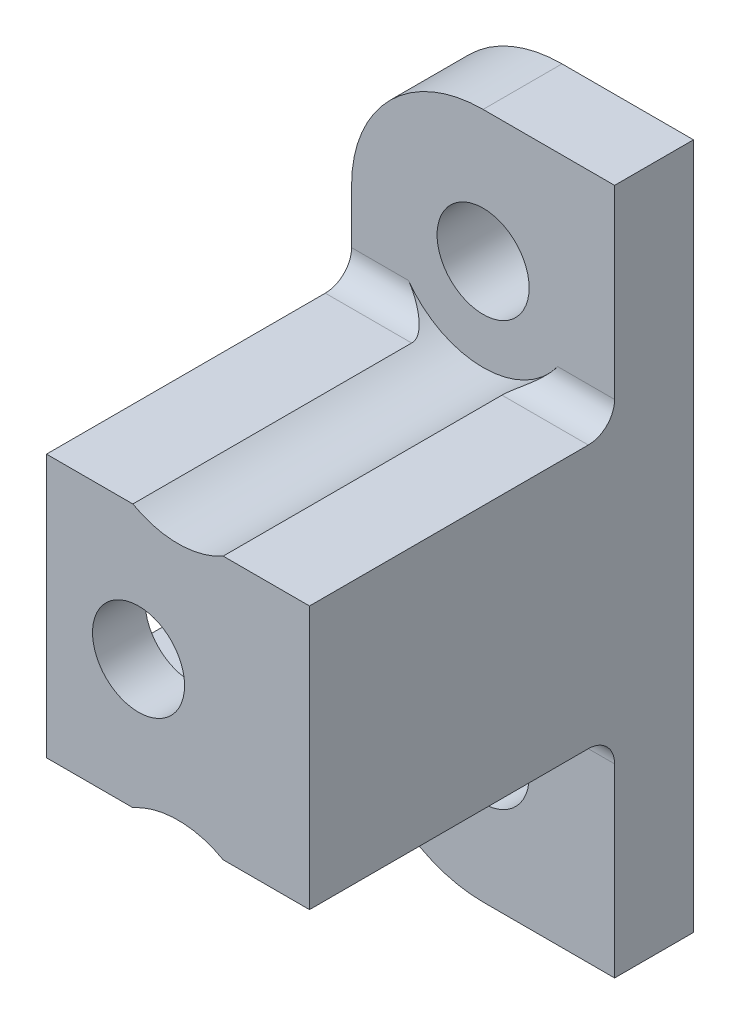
ISO-10303-21;
HEADER;
FILE_DESCRIPTION(('STEP AP214'),'2;1');
FILE_NAME('part.step','',(''),(''),'','','');
FILE_SCHEMA(('AUTOMOTIVE_DESIGN { 1 0 10303 214 1 1 1 1 }'));
ENDSEC;
DATA;
#1=APPLICATION_CONTEXT('core data for automotive mechanical design processes');
#2=APPLICATION_PROTOCOL_DEFINITION('international standard','automotive_design',2000,#1);
#3=PRODUCT_CONTEXT('',#1,'mechanical');
#4=PRODUCT('Part','Part','',(#3));
#5=PRODUCT_RELATED_PRODUCT_CATEGORY('part','',(#4));
#6=PRODUCT_DEFINITION_FORMATION('','',#4);
#7=PRODUCT_DEFINITION_CONTEXT('part definition',#1,'design');
#8=PRODUCT_DEFINITION('design','',#6,#7);
#9=PRODUCT_DEFINITION_SHAPE('','',#8);
#10=(LENGTH_UNIT() NAMED_UNIT(*) SI_UNIT(.MILLI.,.METRE.));
#11=(NAMED_UNIT(*) PLANE_ANGLE_UNIT() SI_UNIT($,.RADIAN.));
#12=(NAMED_UNIT(*) SI_UNIT($,.STERADIAN.) SOLID_ANGLE_UNIT());
#13=UNCERTAINTY_MEASURE_WITH_UNIT(LENGTH_MEASURE(1.E-05),#10,'distance_accuracy_value','');
#14=(GEOMETRIC_REPRESENTATION_CONTEXT(3) GLOBAL_UNCERTAINTY_ASSIGNED_CONTEXT((#13)) GLOBAL_UNIT_ASSIGNED_CONTEXT((#10,
#11,#12)) REPRESENTATION_CONTEXT('',''));
#15=CARTESIAN_POINT('',(0.,0.,0.));
#16=DIRECTION('',(0.,0.,1.));
#17=DIRECTION('',(1.,0.,0.));
#18=AXIS2_PLACEMENT_3D('',#15,#16,#17);
#19=CARTESIAN_POINT('',(-5.5982905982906,-2.46326979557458,14.6));
#20=DIRECTION('',(0.,1.,0.));
#21=DIRECTION('',(0.,0.,1.));
#22=AXIS2_PLACEMENT_3D('',#19,#20,#21);
#23=PLANE('',#22);
#24=DIRECTION('',(1.,0.,0.));
#25=VECTOR('',#24,1.);
#26=CARTESIAN_POINT('',(-5.5982905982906,-2.46326979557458,4.));
#27=LINE('',#26,#25);
#28=CARTESIAN_POINT('',(-5.5982905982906,-2.46326979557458,4.));
#29=VERTEX_POINT('',#28);
#30=CARTESIAN_POINT('',(-2.31511906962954,-2.46326979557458,4.));
#31=VERTEX_POINT('',#30);
#32=EDGE_CURVE('E355',#29,#31,#27,.T.);
#33=ORIENTED_EDGE('',*,*,#32,.T.);
#34=DIRECTION('',(0.,0.,1.));
#35=VECTOR('',#34,1.);
#36=CARTESIAN_POINT('',(-2.31511906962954,-2.46326979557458,-6.89949493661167));
#37=LINE('',#36,#35);
#38=CARTESIAN_POINT('',(-2.31511906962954,-2.46326979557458,14.6));
#39=VERTEX_POINT('',#38);
#40=EDGE_CURVE('E579',#31,#39,#37,.T.);
#41=ORIENTED_EDGE('',*,*,#40,.T.);
#42=DIRECTION('',(1.,0.,0.));
#43=VECTOR('',#42,1.);
#44=CARTESIAN_POINT('',(-5.5982905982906,-2.46326979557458,14.6));
#45=LINE('',#44,#43);
#46=CARTESIAN_POINT('',(-5.5982905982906,-2.46326979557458,14.6));
#47=VERTEX_POINT('',#46);
#48=EDGE_CURVE('E747',#47,#39,#45,.T.);
#49=ORIENTED_EDGE('',*,*,#48,.F.);
#50=DIRECTION('',(0.,0.,-1.));
#51=VECTOR('',#50,1.);
#52=CARTESIAN_POINT('',(-5.5982905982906,-2.46326979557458,14.6));
#53=LINE('',#52,#51);
#54=EDGE_CURVE('E582',#47,#29,#53,.T.);
#55=ORIENTED_EDGE('',*,*,#54,.T.);
#56=EDGE_LOOP('',(#33,#41,#49,#55));
#57=FACE_BOUND('',#56,.T.);
#58=ADVANCED_FACE('F57',(#57),#23,.F.);
#59=CARTESIAN_POINT('',(-5.5982905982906,-3.46326979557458,4.));
#60=DIRECTION('',(1.,0.,0.));
#61=DIRECTION('',(0.,0.,-1.));
#62=AXIS2_PLACEMENT_3D('',#59,#60,#61);
#63=CYLINDRICAL_SURFACE('',#62,1.);
#64=CARTESIAN_POINT('',(1.11853787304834,-2.46326979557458,4.));
#65=VERTEX_POINT('',#64);
#66=CARTESIAN_POINT('',(4.4017094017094,-2.46326979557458,4.));
#67=VERTEX_POINT('',#66);
#68=EDGE_CURVE('E318',#65,#67,#27,.T.);
#69=ORIENTED_EDGE('',*,*,#68,.F.);
#70=CARTESIAN_POINT('',(1.11853787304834,-2.46326979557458,4.));
#71=CARTESIAN_POINT('',(1.11845037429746,-2.46323301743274,3.96920382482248));
#72=CARTESIAN_POINT('',(1.1210624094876,-2.46469007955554,3.93854181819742));
#73=CARTESIAN_POINT('',(1.13085133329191,-2.47022557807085,3.87860625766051));
#74=CARTESIAN_POINT('',(1.13796628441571,-2.47426845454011,3.84931956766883));
#75=CARTESIAN_POINT('',(1.15872224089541,-2.48621219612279,3.7836706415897));
#76=CARTESIAN_POINT('',(1.17369448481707,-2.4949153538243,3.74788798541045));
#77=CARTESIAN_POINT('',(1.2081316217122,-2.51539608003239,3.6793383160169));
#78=CARTESIAN_POINT('',(1.22762388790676,-2.52719244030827,3.64659145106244));
#79=CARTESIAN_POINT('',(1.28395910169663,-2.56219389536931,3.5625723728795));
#80=CARTESIAN_POINT('',(1.32350307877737,-2.58765952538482,3.51408238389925));
#81=CARTESIAN_POINT('',(1.40659294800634,-2.64395071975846,3.42421403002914));
#82=CARTESIAN_POINT('',(1.45014849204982,-2.67478937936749,3.38285354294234));
#83=CARTESIAN_POINT('',(1.52837719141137,-2.7331508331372,3.31560546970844));
#84=CARTESIAN_POINT('',(1.5626620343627,-2.7596823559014,3.2883908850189));
#85=CARTESIAN_POINT('',(1.63171886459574,-2.81530223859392,3.2373977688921));
#86=CARTESIAN_POINT('',(1.66649106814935,-2.84439176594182,3.21362081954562));
#87=CARTESIAN_POINT('',(1.77070067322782,-2.93522237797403,3.1474876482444));
#88=CARTESIAN_POINT('',(1.84022605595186,-3.00066808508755,3.11016696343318));
#89=CARTESIAN_POINT('',(1.96636232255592,-3.13010752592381,3.0549230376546));
#90=CARTESIAN_POINT('',(2.02334778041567,-3.19285046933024,3.03493167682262));
#91=CARTESIAN_POINT('',(2.10622243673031,-3.29123062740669,3.01433861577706));
#92=CARTESIAN_POINT('',(2.13344994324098,-3.3247853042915,3.00903911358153));
#93=CARTESIAN_POINT('',(2.18684168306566,-3.39314496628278,3.00187010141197));
#94=CARTESIAN_POINT('',(2.21300463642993,-3.42795136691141,3.00000460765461));
#95=CARTESIAN_POINT('',(2.23852099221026,-3.46326979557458,3.));
#96=B_SPLINE_CURVE_WITH_KNOTS('',3,(#70,#71,#72,#73,#74,#75,#76,#77,#78,#79,#80,#81,#82,#83,#84,
#85,#86,#87,#88,#89,#90,#91,#92,#93,#94,#95),.UNSPECIFIED.,.F.,.F.,(4,2,2,2,2,2,2,2,2,2,2,2,4),
(0.,0.0920278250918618,0.182816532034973,0.301406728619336,0.420734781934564,0.622282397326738,
0.824328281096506,0.977694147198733,1.13113037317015,1.43714022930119,1.69731500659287,
1.82777078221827,1.95837903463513),.UNSPECIFIED.);
#97=CARTESIAN_POINT('',(2.23852099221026,-3.46326979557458,3.));
#98=VERTEX_POINT('',#97);
#99=EDGE_CURVE('E289',#65,#98,#96,.T.);
#100=ORIENTED_EDGE('',*,*,#99,.T.);
#101=DIRECTION('',(1.,0.,0.));
#102=VECTOR('',#101,1.);
#103=CARTESIAN_POINT('',(0.,-3.46326979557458,3.));
#104=LINE('',#103,#102);
#105=CARTESIAN_POINT('',(4.4017094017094,-3.46326979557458,3.));
#106=VERTEX_POINT('',#105);
#107=EDGE_CURVE('E359',#106,#98,#104,.F.);
#108=ORIENTED_EDGE('',*,*,#107,.F.);
#109=CARTESIAN_POINT('',(4.4017094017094,-3.46326979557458,4.));
#110=DIRECTION('',(-1.,0.,0.));
#111=DIRECTION('',(0.,-1.,0.));
#112=AXIS2_PLACEMENT_3D('',#109,#110,#111);
#113=CIRCLE('',#112,1.);
#114=EDGE_CURVE('E369',#67,#106,#113,.T.);
#115=ORIENTED_EDGE('',*,*,#114,.F.);
#116=EDGE_LOOP('',(#69,#100,#108,#115));
#117=FACE_BOUND('',#116,.T.);
#118=ADVANCED_FACE('F571',(#117),#63,.F.);
#119=CARTESIAN_POINT('',(-5.5982905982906,7.53673020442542,14.6));
#120=DIRECTION('',(0.,-1.,0.));
#121=DIRECTION('',(0.,0.,-1.));
#122=AXIS2_PLACEMENT_3D('',#119,#120,#121);
#123=PLANE('',#122);
#124=DIRECTION('',(-1.,0.,0.));
#125=VECTOR('',#124,1.);
#126=CARTESIAN_POINT('',(-5.5982905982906,7.53673020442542,4.));
#127=LINE('',#126,#125);
#128=CARTESIAN_POINT('',(4.4017094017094,7.53673020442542,4.));
#129=VERTEX_POINT('',#128);
#130=CARTESIAN_POINT('',(1.11853787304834,7.53673020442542,4.));
#131=VERTEX_POINT('',#130);
#132=EDGE_CURVE('E362',#129,#131,#127,.T.);
#133=ORIENTED_EDGE('',*,*,#132,.T.);
#134=DIRECTION('',(0.,0.,1.));
#135=VECTOR('',#134,1.);
#136=CARTESIAN_POINT('',(1.11853787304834,7.53673020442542,-6.89949493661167));
#137=LINE('',#136,#135);
#138=CARTESIAN_POINT('',(1.11853787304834,7.53673020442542,14.6));
#139=VERTEX_POINT('',#138);
#140=EDGE_CURVE('E760',#131,#139,#137,.T.);
#141=ORIENTED_EDGE('',*,*,#140,.T.);
#142=DIRECTION('',(-1.,0.,0.));
#143=VECTOR('',#142,1.);
#144=CARTESIAN_POINT('',(-5.5982905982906,7.53673020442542,14.6));
#145=LINE('',#144,#143);
#146=CARTESIAN_POINT('',(4.4017094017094,7.53673020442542,14.6));
#147=VERTEX_POINT('',#146);
#148=EDGE_CURVE('E628',#147,#139,#145,.T.);
#149=ORIENTED_EDGE('',*,*,#148,.F.);
#150=DIRECTION('',(0.,0.,-1.));
#151=VECTOR('',#150,1.);
#152=CARTESIAN_POINT('',(4.4017094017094,7.53673020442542,14.6));
#153=LINE('',#152,#151);
#154=EDGE_CURVE('E627',#147,#129,#153,.T.);
#155=ORIENTED_EDGE('',*,*,#154,.T.);
#156=EDGE_LOOP('',(#133,#141,#149,#155));
#157=FACE_BOUND('',#156,.T.);
#158=ADVANCED_FACE('F458',(#157),#123,.F.);
#159=CARTESIAN_POINT('',(-5.5982905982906,8.53673020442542,4.));
#160=DIRECTION('',(-1.,0.,0.));
#161=DIRECTION('',(0.,0.,1.));
#162=AXIS2_PLACEMENT_3D('',#159,#160,#161);
#163=CYLINDRICAL_SURFACE('',#162,1.);
#164=CARTESIAN_POINT('',(-2.31511906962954,7.53673020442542,4.));
#165=VERTEX_POINT('',#164);
#166=CARTESIAN_POINT('',(-5.5982905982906,7.53673020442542,4.));
#167=VERTEX_POINT('',#166);
#168=EDGE_CURVE('E361',#165,#167,#127,.T.);
#169=ORIENTED_EDGE('',*,*,#168,.F.);
#170=CARTESIAN_POINT('',(-2.31511906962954,7.53673020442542,4.));
#171=CARTESIAN_POINT('',(-2.31503157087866,7.53669342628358,3.96920382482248));
#172=CARTESIAN_POINT('',(-2.3176436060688,7.53815048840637,3.93854181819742));
#173=CARTESIAN_POINT('',(-2.32743252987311,7.54368598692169,3.87860625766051));
#174=CARTESIAN_POINT('',(-2.33454748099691,7.54772886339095,3.84931956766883));
#175=CARTESIAN_POINT('',(-2.35530343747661,7.55967260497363,3.7836706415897));
#176=CARTESIAN_POINT('',(-2.37027568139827,7.56837576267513,3.74788798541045));
#177=CARTESIAN_POINT('',(-2.4047128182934,7.58885648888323,3.6793383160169));
#178=CARTESIAN_POINT('',(-2.42420508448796,7.6006528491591,3.64659145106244));
#179=CARTESIAN_POINT('',(-2.48054029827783,7.63565430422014,3.5625723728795));
#180=CARTESIAN_POINT('',(-2.52008427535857,7.66111993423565,3.51408238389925));
#181=CARTESIAN_POINT('',(-2.60317414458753,7.7174111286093,3.42421403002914));
#182=CARTESIAN_POINT('',(-2.64672968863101,7.74824978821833,3.38285354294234));
#183=CARTESIAN_POINT('',(-2.72495838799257,7.80661124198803,3.31560546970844));
#184=CARTESIAN_POINT('',(-2.7592432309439,7.83314276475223,3.2883908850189));
#185=CARTESIAN_POINT('',(-2.82830006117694,7.88876264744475,3.2373977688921));
#186=CARTESIAN_POINT('',(-2.86307226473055,7.91785217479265,3.21362081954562));
#187=CARTESIAN_POINT('',(-2.96728186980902,8.00868278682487,3.1474876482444));
#188=CARTESIAN_POINT('',(-3.03680725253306,8.07412849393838,3.11016696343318));
#189=CARTESIAN_POINT('',(-3.16294351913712,8.20356793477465,3.0549230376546));
#190=CARTESIAN_POINT('',(-3.21992897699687,8.26631087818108,3.03493167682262));
#191=CARTESIAN_POINT('',(-3.3028036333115,8.36469103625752,3.01433861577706));
#192=CARTESIAN_POINT('',(-3.33003113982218,8.39824571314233,3.00903911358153));
#193=CARTESIAN_POINT('',(-3.38342287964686,8.46660537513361,3.00187010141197));
#194=CARTESIAN_POINT('',(-3.40958583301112,8.50141177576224,3.00000460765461));
#195=CARTESIAN_POINT('',(-3.43510218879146,8.53673020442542,3.));
#196=B_SPLINE_CURVE_WITH_KNOTS('',3,(#170,#171,#172,#173,#174,#175,#176,#177,#178,#179,#180,
#181,#182,#183,#184,#185,#186,#187,#188,#189,#190,#191,#192,#193,#194,#195),.UNSPECIFIED.,.F.,
.F.,(4,2,2,2,2,2,2,2,2,2,2,2,4),(0.,0.0920278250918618,0.182816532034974,0.301406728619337,
0.420734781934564,0.622282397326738,0.824328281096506,0.977694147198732,1.13113037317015,
1.43714022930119,1.69731500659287,1.82777078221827,1.95837903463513),.UNSPECIFIED.);
#197=CARTESIAN_POINT('',(-3.43510218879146,8.53673020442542,3.));
#198=VERTEX_POINT('',#197);
#199=EDGE_CURVE('E389',#165,#198,#196,.T.);
#200=ORIENTED_EDGE('',*,*,#199,.T.);
#201=DIRECTION('',(-1.,0.,0.));
#202=VECTOR('',#201,1.);
#203=CARTESIAN_POINT('',(0.,8.53673020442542,3.));
#204=LINE('',#203,#202);
#205=CARTESIAN_POINT('',(-5.5982905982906,8.53673020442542,3.));
#206=VERTEX_POINT('',#205);
#207=EDGE_CURVE('E366',#206,#198,#204,.F.);
#208=ORIENTED_EDGE('',*,*,#207,.F.);
#209=CARTESIAN_POINT('',(-5.5982905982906,8.53673020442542,4.));
#210=DIRECTION('',(1.,0.,0.));
#211=DIRECTION('',(0.,1.,0.));
#212=AXIS2_PLACEMENT_3D('',#209,#210,#211);
#213=CIRCLE('',#212,1.);
#214=EDGE_CURVE('E374',#167,#206,#213,.T.);
#215=ORIENTED_EDGE('',*,*,#214,.F.);
#216=EDGE_LOOP('',(#169,#200,#208,#215));
#217=FACE_BOUND('',#216,.T.);
#218=ADVANCED_FACE('F494',(#217),#163,.F.);
#219=CARTESIAN_POINT('',(-5.5982905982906,15.5867302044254,3.));
#220=DIRECTION('',(1.,0.,0.));
#221=DIRECTION('',(0.,1.,0.));
#222=AXIS2_PLACEMENT_3D('',#219,#220,#221);
#223=PLANE('',#222);
#224=DIRECTION('',(0.,0.,-1.));
#225=VECTOR('',#224,1.);
#226=CARTESIAN_POINT('',(-5.5982905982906,7.53673020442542,14.6));
#227=LINE('',#226,#225);
#228=CARTESIAN_POINT('',(-5.5982905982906,7.53673020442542,14.6));
#229=VERTEX_POINT('',#228);
#230=EDGE_CURVE('E620',#229,#167,#227,.T.);
#231=ORIENTED_EDGE('',*,*,#230,.T.);
#232=ORIENTED_EDGE('',*,*,#214,.T.);
#233=DIRECTION('',(0.,-1.,0.));
#234=VECTOR('',#233,1.);
#235=CARTESIAN_POINT('',(-5.5982905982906,15.5867302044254,3.));
#236=LINE('',#235,#234);
#237=CARTESIAN_POINT('',(-5.5982905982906,10.5867302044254,3.));
#238=VERTEX_POINT('',#237);
#239=EDGE_CURVE('E653',#238,#206,#236,.T.);
#240=ORIENTED_EDGE('',*,*,#239,.F.);
#241=DIRECTION('',(0.,0.,-1.));
#242=VECTOR('',#241,1.);
#243=CARTESIAN_POINT('',(-5.5982905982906,10.5867302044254,3.));
#244=LINE('',#243,#242);
#245=CARTESIAN_POINT('',(-5.5982905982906,10.5867302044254,0.));
#246=VERTEX_POINT('',#245);
#247=EDGE_CURVE('E687',#238,#246,#244,.T.);
#248=ORIENTED_EDGE('',*,*,#247,.T.);
#249=DIRECTION('',(0.,-1.,0.));
#250=VECTOR('',#249,1.);
#251=CARTESIAN_POINT('',(-5.5982905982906,15.5867302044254,0.));
#252=LINE('',#251,#250);
#253=CARTESIAN_POINT('',(-5.5982905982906,-5.51326979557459,0.));
#254=VERTEX_POINT('',#253);
#255=EDGE_CURVE('E650',#246,#254,#252,.T.);
#256=ORIENTED_EDGE('',*,*,#255,.T.);
#257=DIRECTION('',(0.,0.,-1.));
#258=VECTOR('',#257,1.);
#259=CARTESIAN_POINT('',(-5.5982905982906,-5.51326979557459,3.));
#260=LINE('',#259,#258);
#261=CARTESIAN_POINT('',(-5.5982905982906,-5.51326979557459,3.));
#262=VERTEX_POINT('',#261);
#263=EDGE_CURVE('E690',#254,#262,#260,.F.);
#264=ORIENTED_EDGE('',*,*,#263,.T.);
#265=CARTESIAN_POINT('',(-5.5982905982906,-3.46326979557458,3.));
#266=VERTEX_POINT('',#265);
#267=EDGE_CURVE('E656',#266,#262,#236,.T.);
#268=ORIENTED_EDGE('',*,*,#267,.F.);
#269=CARTESIAN_POINT('',(-5.5982905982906,-3.46326979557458,4.));
#270=DIRECTION('',(1.,0.,0.));
#271=DIRECTION('',(0.,1.,0.));
#272=AXIS2_PLACEMENT_3D('',#269,#270,#271);
#273=CIRCLE('',#272,1.);
#274=EDGE_CURVE('E371',#266,#29,#273,.T.);
#275=ORIENTED_EDGE('',*,*,#274,.T.);
#276=ORIENTED_EDGE('',*,*,#54,.F.);
#277=DIRECTION('',(0.,-1.,0.));
#278=VECTOR('',#277,1.);
#279=CARTESIAN_POINT('',(-5.5982905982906,7.53673020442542,14.6));
#280=LINE('',#279,#278);
#281=EDGE_CURVE('E354',#229,#47,#280,.T.);
#282=ORIENTED_EDGE('',*,*,#281,.F.);
#283=EDGE_LOOP('',(#231,#232,#240,#248,#256,#264,#268,#275,#276,#282));
#284=FACE_BOUND('',#283,.T.);
#285=DIRECTION('',(0.,-1.,0.));
#286=VECTOR('',#285,1.);
#287=CARTESIAN_POINT('',(-5.5982905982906,5.43673020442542,9.8));
#288=LINE('',#287,#286);
#289=CARTESIAN_POINT('',(-5.5982905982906,5.43673020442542,9.8));
#290=VERTEX_POINT('',#289);
#291=CARTESIAN_POINT('',(-5.5982905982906,-0.363269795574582,9.8));
#292=VERTEX_POINT('',#291);
#293=EDGE_CURVE('E769',#290,#292,#288,.T.);
#294=ORIENTED_EDGE('',*,*,#293,.F.);
#295=DIRECTION('',(0.,0.,1.));
#296=VECTOR('',#295,1.);
#297=CARTESIAN_POINT('',(-5.5982905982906,5.43673020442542,9.8));
#298=LINE('',#297,#296);
#299=CARTESIAN_POINT('',(-5.5982905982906,5.43673020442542,12.6));
#300=VERTEX_POINT('',#299);
#301=EDGE_CURVE('E793',#290,#300,#298,.T.);
#302=ORIENTED_EDGE('',*,*,#301,.T.);
#303=DIRECTION('',(0.,-1.,0.));
#304=VECTOR('',#303,1.);
#305=CARTESIAN_POINT('',(-5.5982905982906,5.43673020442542,12.6));
#306=LINE('',#305,#304);
#307=CARTESIAN_POINT('',(-5.5982905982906,-0.36326979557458,12.6));
#308=VERTEX_POINT('',#307);
#309=EDGE_CURVE('E768',#300,#308,#306,.T.);
#310=ORIENTED_EDGE('',*,*,#309,.T.);
#311=DIRECTION('',(0.,0.,1.));
#312=VECTOR('',#311,1.);
#313=CARTESIAN_POINT('',(-5.5982905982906,-0.363269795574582,9.8));
#314=LINE('',#313,#312);
#315=EDGE_CURVE('E782',#292,#308,#314,.T.);
#316=ORIENTED_EDGE('',*,*,#315,.F.);
#317=EDGE_LOOP('',(#294,#302,#310,#316));
#318=FACE_BOUND('',#317,.T.);
#319=ADVANCED_FACE('F491',(#284,#318),#223,.F.);
#320=CARTESIAN_POINT('',(0.,0.,3.));
#321=DIRECTION('',(0.,0.,1.));
#322=DIRECTION('',(1.,0.,0.));
#323=AXIS2_PLACEMENT_3D('',#320,#321,#322);
#324=PLANE('',#323);
#325=ORIENTED_EDGE('',*,*,#207,.T.);
#326=CARTESIAN_POINT('',(-0.598290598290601,10.5867302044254,3.));
#327=DIRECTION('',(0.,0.,1.));
#328=DIRECTION('',(1.,0.,0.));
#329=AXIS2_PLACEMENT_3D('',#326,#327,#328);
#330=CIRCLE('',#329,3.5);
#331=CARTESIAN_POINT('',(2.23852099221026,8.53673020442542,3.));
#332=VERTEX_POINT('',#331);
#333=EDGE_CURVE('E757',#332,#198,#330,.F.);
#334=ORIENTED_EDGE('',*,*,#333,.F.);
#335=CARTESIAN_POINT('',(4.4017094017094,8.53673020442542,3.));
#336=VERTEX_POINT('',#335);
#337=EDGE_CURVE('E365',#332,#336,#204,.F.);
#338=ORIENTED_EDGE('',*,*,#337,.T.);
#339=DIRECTION('',(0.,1.,0.));
#340=VECTOR('',#339,1.);
#341=CARTESIAN_POINT('',(4.4017094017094,15.5867302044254,3.));
#342=LINE('',#341,#340);
#343=CARTESIAN_POINT('',(4.4017094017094,15.5867302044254,3.));
#344=VERTEX_POINT('',#343);
#345=EDGE_CURVE('E658',#336,#344,#342,.T.);
#346=ORIENTED_EDGE('',*,*,#345,.T.);
#347=DIRECTION('',(-1.,0.,0.));
#348=VECTOR('',#347,1.);
#349=CARTESIAN_POINT('',(-5.5982905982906,15.5867302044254,3.));
#350=LINE('',#349,#348);
#351=CARTESIAN_POINT('',(-0.598290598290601,15.5867302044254,3.));
#352=VERTEX_POINT('',#351);
#353=EDGE_CURVE('E662',#344,#352,#350,.T.);
#354=ORIENTED_EDGE('',*,*,#353,.T.);
#355=CARTESIAN_POINT('',(-0.598290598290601,10.5867302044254,3.));
#356=DIRECTION('',(0.,0.,1.));
#357=DIRECTION('',(1.,0.,0.));
#358=AXIS2_PLACEMENT_3D('',#355,#356,#357);
#359=CIRCLE('',#358,5.);
#360=EDGE_CURVE('E693',#352,#238,#359,.T.);
#361=ORIENTED_EDGE('',*,*,#360,.T.);
#362=ORIENTED_EDGE('',*,*,#239,.T.);
#363=EDGE_LOOP('',(#325,#334,#338,#346,#354,#361,#362));
#364=FACE_BOUND('',#363,.T.);
#365=CARTESIAN_POINT('',(-0.598290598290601,10.5867302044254,3.));
#366=DIRECTION('',(0.,0.,1.));
#367=DIRECTION('',(1.,0.,0.));
#368=AXIS2_PLACEMENT_3D('',#365,#366,#367);
#369=CIRCLE('',#368,1.75);
#370=CARTESIAN_POINT('',(1.1517094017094,10.5867302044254,3.));
#371=VERTEX_POINT('',#370);
#372=EDGE_CURVE('E647',#371,#371,#369,.T.);
#373=ORIENTED_EDGE('',*,*,#372,.F.);
#374=EDGE_LOOP('',(#373));
#375=FACE_BOUND('',#374,.T.);
#376=ADVANCED_FACE('F476',(#364,#375),#324,.T.);
#377=ORIENTED_EDGE('',*,*,#107,.T.);
#378=CARTESIAN_POINT('',(-0.598290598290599,-5.51326979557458,3.));
#379=DIRECTION('',(0.,0.,1.));
#380=DIRECTION('',(1.,0.,0.));
#381=AXIS2_PLACEMENT_3D('',#378,#379,#380);
#382=CIRCLE('',#381,3.5);
#383=CARTESIAN_POINT('',(-3.43510218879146,-3.46326979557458,3.));
#384=VERTEX_POINT('',#383);
#385=EDGE_CURVE('E80',#384,#98,#382,.F.);
#386=ORIENTED_EDGE('',*,*,#385,.F.);
#387=EDGE_CURVE('E358',#384,#266,#104,.F.);
#388=ORIENTED_EDGE('',*,*,#387,.T.);
#389=ORIENTED_EDGE('',*,*,#267,.T.);
#390=CARTESIAN_POINT('',(-0.598290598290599,-5.51326979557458,3.));
#391=DIRECTION('',(0.,0.,1.));
#392=DIRECTION('',(1.,0.,0.));
#393=AXIS2_PLACEMENT_3D('',#390,#391,#392);
#394=CIRCLE('',#393,5.);
#395=CARTESIAN_POINT('',(-0.598290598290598,-10.5132697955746,3.));
#396=VERTEX_POINT('',#395);
#397=EDGE_CURVE('E695',#262,#396,#394,.T.);
#398=ORIENTED_EDGE('',*,*,#397,.T.);
#399=DIRECTION('',(1.,0.,0.));
#400=VECTOR('',#399,1.);
#401=CARTESIAN_POINT('',(-5.5982905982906,-10.5132697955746,3.));
#402=LINE('',#401,#400);
#403=CARTESIAN_POINT('',(4.4017094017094,-10.5132697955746,3.));
#404=VERTEX_POINT('',#403);
#405=EDGE_CURVE('E655',#396,#404,#402,.T.);
#406=ORIENTED_EDGE('',*,*,#405,.T.);
#407=EDGE_CURVE('E659',#404,#106,#342,.T.);
#408=ORIENTED_EDGE('',*,*,#407,.T.);
#409=EDGE_LOOP('',(#377,#386,#388,#389,#398,#406,#408));
#410=FACE_BOUND('',#409,.T.);
#411=CARTESIAN_POINT('',(-0.598290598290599,-5.51326979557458,3.));
#412=DIRECTION('',(0.,0.,1.));
#413=DIRECTION('',(1.,0.,0.));
#414=AXIS2_PLACEMENT_3D('',#411,#412,#413);
#415=CIRCLE('',#414,1.75);
#416=CARTESIAN_POINT('',(1.1517094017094,-5.51326979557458,3.));
#417=VERTEX_POINT('',#416);
#418=EDGE_CURVE('E641',#417,#417,#415,.T.);
#419=ORIENTED_EDGE('',*,*,#418,.F.);
#420=EDGE_LOOP('',(#419));
#421=FACE_BOUND('',#420,.T.);
#422=ADVANCED_FACE('F472',(#410,#421),#324,.T.);
#423=CARTESIAN_POINT('',(0.,0.,0.));
#424=DIRECTION('',(0.,0.,1.));
#425=DIRECTION('',(1.,0.,0.));
#426=AXIS2_PLACEMENT_3D('',#423,#424,#425);
#427=PLANE('',#426);
#428=CARTESIAN_POINT('',(-2.0982905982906,2.53673020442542,0.));
#429=DIRECTION('',(0.,0.,1.));
#430=DIRECTION('',(1.,0.,0.));
#431=AXIS2_PLACEMENT_3D('',#428,#429,#430);
#432=CIRCLE('',#431,1.75);
#433=CARTESIAN_POINT('',(-0.3482905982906,2.53673020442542,0.));
#434=VERTEX_POINT('',#433);
#435=EDGE_CURVE('E1180',#434,#434,#432,.T.);
#436=ORIENTED_EDGE('',*,*,#435,.T.);
#437=EDGE_LOOP('',(#436));
#438=FACE_BOUND('',#437,.T.);
#439=DIRECTION('',(1.,0.,0.));
#440=VECTOR('',#439,1.);
#441=CARTESIAN_POINT('',(-5.5982905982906,-10.5132697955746,0.));
#442=LINE('',#441,#440);
#443=CARTESIAN_POINT('',(-0.598290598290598,-10.5132697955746,0.));
#444=VERTEX_POINT('',#443);
#445=CARTESIAN_POINT('',(4.4017094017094,-10.5132697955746,0.));
#446=VERTEX_POINT('',#445);
#447=EDGE_CURVE('E668',#444,#446,#442,.T.);
#448=ORIENTED_EDGE('',*,*,#447,.F.);
#449=CARTESIAN_POINT('',(-0.598290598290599,-5.51326979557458,0.));
#450=DIRECTION('',(0.,0.,1.));
#451=DIRECTION('',(1.,0.,0.));
#452=AXIS2_PLACEMENT_3D('',#449,#450,#451);
#453=CIRCLE('',#452,5.);
#454=EDGE_CURVE('E685',#444,#254,#453,.F.);
#455=ORIENTED_EDGE('',*,*,#454,.T.);
#456=ORIENTED_EDGE('',*,*,#255,.F.);
#457=CARTESIAN_POINT('',(-0.598290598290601,10.5867302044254,0.));
#458=DIRECTION('',(0.,0.,1.));
#459=DIRECTION('',(1.,0.,0.));
#460=AXIS2_PLACEMENT_3D('',#457,#458,#459);
#461=CIRCLE('',#460,5.);
#462=CARTESIAN_POINT('',(-0.598290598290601,15.5867302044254,0.));
#463=VERTEX_POINT('',#462);
#464=EDGE_CURVE('E683',#246,#463,#461,.F.);
#465=ORIENTED_EDGE('',*,*,#464,.T.);
#466=DIRECTION('',(-1.,0.,0.));
#467=VECTOR('',#466,1.);
#468=CARTESIAN_POINT('',(-5.5982905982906,15.5867302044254,0.));
#469=LINE('',#468,#467);
#470=CARTESIAN_POINT('',(4.4017094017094,15.5867302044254,0.));
#471=VERTEX_POINT('',#470);
#472=EDGE_CURVE('E672',#471,#463,#469,.T.);
#473=ORIENTED_EDGE('',*,*,#472,.F.);
#474=DIRECTION('',(0.,1.,0.));
#475=VECTOR('',#474,1.);
#476=CARTESIAN_POINT('',(4.4017094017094,15.5867302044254,0.));
#477=LINE('',#476,#475);
#478=EDGE_CURVE('E670',#446,#471,#477,.T.);
#479=ORIENTED_EDGE('',*,*,#478,.F.);
#480=EDGE_LOOP('',(#448,#455,#456,#465,#473,#479));
#481=FACE_BOUND('',#480,.T.);
#482=CARTESIAN_POINT('',(-0.598290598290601,10.5867302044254,0.));
#483=DIRECTION('',(0.,0.,1.));
#484=DIRECTION('',(1.,0.,0.));
#485=AXIS2_PLACEMENT_3D('',#482,#483,#484);
#486=CIRCLE('',#485,1.75);
#487=CARTESIAN_POINT('',(1.1517094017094,10.5867302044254,0.));
#488=VERTEX_POINT('',#487);
#489=EDGE_CURVE('E644',#488,#488,#486,.T.);
#490=ORIENTED_EDGE('',*,*,#489,.T.);
#491=EDGE_LOOP('',(#490));
#492=FACE_BOUND('',#491,.T.);
#493=CARTESIAN_POINT('',(-0.598290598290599,-5.51326979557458,0.));
#494=DIRECTION('',(0.,0.,1.));
#495=DIRECTION('',(1.,0.,0.));
#496=AXIS2_PLACEMENT_3D('',#493,#494,#495);
#497=CIRCLE('',#496,1.75);
#498=CARTESIAN_POINT('',(1.1517094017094,-5.51326979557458,0.));
#499=VERTEX_POINT('',#498);
#500=EDGE_CURVE('E640',#499,#499,#497,.T.);
#501=ORIENTED_EDGE('',*,*,#500,.T.);
#502=EDGE_LOOP('',(#501));
#503=FACE_BOUND('',#502,.T.);
#504=ADVANCED_FACE('F475',(#438,#481,#492,#503),#427,.F.);
#505=CARTESIAN_POINT('',(-5.5982905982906,-10.5132697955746,3.));
#506=DIRECTION('',(0.,1.,0.));
#507=DIRECTION('',(-1.,0.,0.));
#508=AXIS2_PLACEMENT_3D('',#505,#506,#507);
#509=PLANE('',#508);
#510=ORIENTED_EDGE('',*,*,#405,.F.);
#511=DIRECTION('',(0.,0.,-1.));
#512=VECTOR('',#511,1.);
#513=CARTESIAN_POINT('',(-0.598290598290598,-10.5132697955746,3.));
#514=LINE('',#513,#512);
#515=EDGE_CURVE('E680',#396,#444,#514,.T.);
#516=ORIENTED_EDGE('',*,*,#515,.T.);
#517=ORIENTED_EDGE('',*,*,#447,.T.);
#518=DIRECTION('',(0.,0.,-1.));
#519=VECTOR('',#518,1.);
#520=CARTESIAN_POINT('',(4.4017094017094,-10.5132697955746,3.));
#521=LINE('',#520,#519);
#522=EDGE_CURVE('E677',#404,#446,#521,.T.);
#523=ORIENTED_EDGE('',*,*,#522,.F.);
#524=EDGE_LOOP('',(#510,#516,#517,#523));
#525=FACE_BOUND('',#524,.T.);
#526=ADVANCED_FACE('F479',(#525),#509,.F.);
#527=CARTESIAN_POINT('',(4.4017094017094,15.5867302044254,3.));
#528=DIRECTION('',(-1.,0.,0.));
#529=DIRECTION('',(0.,-1.,0.));
#530=AXIS2_PLACEMENT_3D('',#527,#528,#529);
#531=PLANE('',#530);
#532=DIRECTION('',(0.,0.,-1.));
#533=VECTOR('',#532,1.);
#534=CARTESIAN_POINT('',(4.4017094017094,-2.46326979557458,14.6));
#535=LINE('',#534,#533);
#536=CARTESIAN_POINT('',(4.4017094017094,-2.46326979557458,14.6));
#537=VERTEX_POINT('',#536);
#538=EDGE_CURVE('E630',#537,#67,#535,.T.);
#539=ORIENTED_EDGE('',*,*,#538,.T.);
#540=ORIENTED_EDGE('',*,*,#114,.T.);
#541=ORIENTED_EDGE('',*,*,#407,.F.);
#542=ORIENTED_EDGE('',*,*,#522,.T.);
#543=ORIENTED_EDGE('',*,*,#478,.T.);
#544=DIRECTION('',(0.,0.,-1.));
#545=VECTOR('',#544,1.);
#546=CARTESIAN_POINT('',(4.4017094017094,15.5867302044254,3.));
#547=LINE('',#546,#545);
#548=EDGE_CURVE('E665',#344,#471,#547,.T.);
#549=ORIENTED_EDGE('',*,*,#548,.F.);
#550=ORIENTED_EDGE('',*,*,#345,.F.);
#551=CARTESIAN_POINT('',(4.4017094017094,8.53673020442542,4.));
#552=DIRECTION('',(-1.,0.,0.));
#553=DIRECTION('',(0.,-1.,0.));
#554=AXIS2_PLACEMENT_3D('',#551,#552,#553);
#555=CIRCLE('',#554,1.);
#556=EDGE_CURVE('E376',#336,#129,#555,.T.);
#557=ORIENTED_EDGE('',*,*,#556,.T.);
#558=ORIENTED_EDGE('',*,*,#154,.F.);
#559=DIRECTION('',(0.,1.,0.));
#560=VECTOR('',#559,1.);
#561=CARTESIAN_POINT('',(4.4017094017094,7.53673020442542,14.6));
#562=LINE('',#561,#560);
#563=EDGE_CURVE('E748',#537,#147,#562,.T.);
#564=ORIENTED_EDGE('',*,*,#563,.F.);
#565=EDGE_LOOP('',(#539,#540,#541,#542,#543,#549,#550,#557,#558,#564));
#566=FACE_BOUND('',#565,.T.);
#567=ADVANCED_FACE('F483',(#566),#531,.F.);
#568=CARTESIAN_POINT('',(-5.5982905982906,15.5867302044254,3.));
#569=DIRECTION('',(0.,-1.,0.));
#570=DIRECTION('',(1.,0.,0.));
#571=AXIS2_PLACEMENT_3D('',#568,#569,#570);
#572=PLANE('',#571);
#573=ORIENTED_EDGE('',*,*,#472,.T.);
#574=DIRECTION('',(0.,0.,-1.));
#575=VECTOR('',#574,1.);
#576=CARTESIAN_POINT('',(-0.598290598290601,15.5867302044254,3.));
#577=LINE('',#576,#575);
#578=EDGE_CURVE('E697',#463,#352,#577,.F.);
#579=ORIENTED_EDGE('',*,*,#578,.T.);
#580=ORIENTED_EDGE('',*,*,#353,.F.);
#581=ORIENTED_EDGE('',*,*,#548,.T.);
#582=EDGE_LOOP('',(#573,#579,#580,#581));
#583=FACE_BOUND('',#582,.T.);
#584=ADVANCED_FACE('F470',(#583),#572,.F.);
#585=CARTESIAN_POINT('',(-0.598290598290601,10.5867302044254,3.));
#586=DIRECTION('',(0.,0.,-1.));
#587=DIRECTION('',(-1.,0.,0.));
#588=AXIS2_PLACEMENT_3D('',#585,#586,#587);
#589=CYLINDRICAL_SURFACE('',#588,1.75);
#590=ORIENTED_EDGE('',*,*,#372,.T.);
#591=EDGE_LOOP('',(#590));
#592=FACE_BOUND('',#591,.T.);
#593=ORIENTED_EDGE('',*,*,#489,.F.);
#594=EDGE_LOOP('',(#593));
#595=FACE_BOUND('',#594,.T.);
#596=ADVANCED_FACE('F466',(#592,#595),#589,.F.);
#597=CARTESIAN_POINT('',(-0.598290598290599,-5.51326979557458,3.));
#598=DIRECTION('',(0.,0.,-1.));
#599=DIRECTION('',(-1.,0.,0.));
#600=AXIS2_PLACEMENT_3D('',#597,#598,#599);
#601=CYLINDRICAL_SURFACE('',#600,1.75);
#602=ORIENTED_EDGE('',*,*,#418,.T.);
#603=EDGE_LOOP('',(#602));
#604=FACE_BOUND('',#603,.T.);
#605=ORIENTED_EDGE('',*,*,#500,.F.);
#606=EDGE_LOOP('',(#605));
#607=FACE_BOUND('',#606,.T.);
#608=ADVANCED_FACE('F462',(#604,#607),#601,.F.);
#609=CARTESIAN_POINT('',(-0.598290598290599,-5.51326979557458,3.));
#610=DIRECTION('',(0.,0.,-1.));
#611=DIRECTION('',(-1.,0.,0.));
#612=AXIS2_PLACEMENT_3D('',#609,#610,#611);
#613=CYLINDRICAL_SURFACE('',#612,5.);
#614=ORIENTED_EDGE('',*,*,#397,.F.);
#615=ORIENTED_EDGE('',*,*,#263,.F.);
#616=ORIENTED_EDGE('',*,*,#454,.F.);
#617=ORIENTED_EDGE('',*,*,#515,.F.);
#618=EDGE_LOOP('',(#614,#615,#616,#617));
#619=FACE_BOUND('',#618,.T.);
#620=ADVANCED_FACE('F465',(#619),#613,.T.);
#621=CARTESIAN_POINT('',(-0.598290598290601,10.5867302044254,3.));
#622=DIRECTION('',(0.,0.,-1.));
#623=DIRECTION('',(-1.,0.,0.));
#624=AXIS2_PLACEMENT_3D('',#621,#622,#623);
#625=CYLINDRICAL_SURFACE('',#624,5.);
#626=ORIENTED_EDGE('',*,*,#360,.F.);
#627=ORIENTED_EDGE('',*,*,#578,.F.);
#628=ORIENTED_EDGE('',*,*,#464,.F.);
#629=ORIENTED_EDGE('',*,*,#247,.F.);
#630=EDGE_LOOP('',(#626,#627,#628,#629));
#631=FACE_BOUND('',#630,.T.);
#632=ADVANCED_FACE('F451',(#631),#625,.T.);
#633=CARTESIAN_POINT('',(0.,0.,14.6));
#634=DIRECTION('',(0.,0.,1.));
#635=DIRECTION('',(1.,0.,0.));
#636=AXIS2_PLACEMENT_3D('',#633,#634,#635);
#637=PLANE('',#636);
#638=CARTESIAN_POINT('',(-2.0982905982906,2.53673020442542,14.6));
#639=DIRECTION('',(0.,0.,1.));
#640=DIRECTION('',(1.,0.,0.));
#641=AXIS2_PLACEMENT_3D('',#638,#639,#640);
#642=CIRCLE('',#641,1.75);
#643=CARTESIAN_POINT('',(-0.3482905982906,2.53673020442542,14.6));
#644=VERTEX_POINT('',#643);
#645=EDGE_CURVE('E299',#644,#644,#642,.T.);
#646=ORIENTED_EDGE('',*,*,#645,.F.);
#647=EDGE_LOOP('',(#646));
#648=FACE_BOUND('',#647,.T.);
#649=CARTESIAN_POINT('',(-0.598290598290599,-5.51326979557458,14.6));
#650=DIRECTION('',(0.,0.,1.));
#651=DIRECTION('',(1.,0.,0.));
#652=AXIS2_PLACEMENT_3D('',#649,#650,#651);
#653=CIRCLE('',#652,3.5);
#654=CARTESIAN_POINT('',(1.11853787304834,-2.46326979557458,14.6));
#655=VERTEX_POINT('',#654);
#656=EDGE_CURVE('E1179',#655,#39,#653,.T.);
#657=ORIENTED_EDGE('',*,*,#656,.F.);
#658=EDGE_CURVE('E746',#655,#537,#45,.T.);
#659=ORIENTED_EDGE('',*,*,#658,.T.);
#660=ORIENTED_EDGE('',*,*,#563,.T.);
#661=ORIENTED_EDGE('',*,*,#148,.T.);
#662=CARTESIAN_POINT('',(-0.598290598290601,10.5867302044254,14.6));
#663=DIRECTION('',(0.,0.,1.));
#664=DIRECTION('',(1.,0.,0.));
#665=AXIS2_PLACEMENT_3D('',#662,#663,#664);
#666=CIRCLE('',#665,3.5);
#667=CARTESIAN_POINT('',(-2.31511906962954,7.53673020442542,14.6));
#668=VERTEX_POINT('',#667);
#669=EDGE_CURVE('E754',#668,#139,#666,.T.);
#670=ORIENTED_EDGE('',*,*,#669,.F.);
#671=EDGE_CURVE('E633',#668,#229,#145,.T.);
#672=ORIENTED_EDGE('',*,*,#671,.T.);
#673=ORIENTED_EDGE('',*,*,#281,.T.);
#674=ORIENTED_EDGE('',*,*,#48,.T.);
#675=EDGE_LOOP('',(#657,#659,#660,#661,#670,#672,#673,#674));
#676=FACE_BOUND('',#675,.T.);
#677=ADVANCED_FACE('F447',(#648,#676),#637,.T.);
#678=ORIENTED_EDGE('',*,*,#658,.F.);
#679=DIRECTION('',(0.,0.,1.));
#680=VECTOR('',#679,1.);
#681=CARTESIAN_POINT('',(1.11853787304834,-2.46326979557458,-6.89949493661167));
#682=LINE('',#681,#680);
#683=EDGE_CURVE('E758',#655,#65,#682,.F.);
#684=ORIENTED_EDGE('',*,*,#683,.T.);
#685=ORIENTED_EDGE('',*,*,#68,.T.);
#686=ORIENTED_EDGE('',*,*,#538,.F.);
#687=EDGE_LOOP('',(#678,#684,#685,#686));
#688=FACE_BOUND('',#687,.T.);
#689=ADVANCED_FACE('F450',(#688),#23,.F.);
#690=ORIENTED_EDGE('',*,*,#671,.F.);
#691=DIRECTION('',(0.,0.,1.));
#692=VECTOR('',#691,1.);
#693=CARTESIAN_POINT('',(-2.31511906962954,7.53673020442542,-6.89949493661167));
#694=LINE('',#693,#692);
#695=EDGE_CURVE('E622',#668,#165,#694,.F.);
#696=ORIENTED_EDGE('',*,*,#695,.T.);
#697=ORIENTED_EDGE('',*,*,#168,.T.);
#698=ORIENTED_EDGE('',*,*,#230,.F.);
#699=EDGE_LOOP('',(#690,#696,#697,#698));
#700=FACE_BOUND('',#699,.T.);
#701=ADVANCED_FACE('F453',(#700),#123,.F.);
#702=ORIENTED_EDGE('',*,*,#387,.F.);
#703=CARTESIAN_POINT('',(-3.43510218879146,-3.46326979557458,3.));
#704=CARTESIAN_POINT('',(-3.41016696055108,-3.42875747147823,3.00000450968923));
#705=CARTESIAN_POINT('',(-3.38461683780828,-3.39473497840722,3.00178579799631));
#706=CARTESIAN_POINT('',(-3.33249147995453,-3.32787846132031,3.0086378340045));
#707=CARTESIAN_POINT('',(-3.30591733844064,-3.29504323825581,3.01370515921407));
#708=CARTESIAN_POINT('',(-3.22511848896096,-3.19880241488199,3.03339002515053));
#709=CARTESIAN_POINT('',(-3.16959926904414,-3.13736116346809,3.0524951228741));
#710=CARTESIAN_POINT('',(-3.05449370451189,-3.01843548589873,3.10197999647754));
#711=CARTESIAN_POINT('',(-2.99483320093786,-2.9611992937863,3.13277094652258));
#712=CARTESIAN_POINT('',(-2.87503574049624,-2.85377799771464,3.2045717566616));
#713=CARTESIAN_POINT('',(-2.81489810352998,-2.80360621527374,3.24560052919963));
#714=CARTESIAN_POINT('',(-2.70902987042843,-2.72072365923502,3.32821695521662));
#715=CARTESIAN_POINT('',(-2.662925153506,-2.68655841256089,3.36787904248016));
#716=CARTESIAN_POINT('',(-2.57381293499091,-2.62358962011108,3.45429316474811));
#717=CARTESIAN_POINT('',(-2.53079813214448,-2.59477316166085,3.50102761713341));
#718=CARTESIAN_POINT('',(-2.46791842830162,-2.55434046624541,3.58173236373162));
#719=CARTESIAN_POINT('',(-2.44587465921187,-2.540559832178,3.61290934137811));
#720=CARTESIAN_POINT('',(-2.40527893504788,-2.51571170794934,3.67850232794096));
#721=CARTESIAN_POINT('',(-2.38672295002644,-2.50464108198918,3.71291452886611));
#722=CARTESIAN_POINT('',(-2.35857683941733,-2.48810924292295,3.77666056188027));
#723=CARTESIAN_POINT('',(-2.34790559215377,-2.48194277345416,3.80532632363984));
#724=CARTESIAN_POINT('',(-2.33070652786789,-2.47207998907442,3.86425363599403));
#725=CARTESIAN_POINT('',(-2.32416581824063,-2.46837598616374,3.89450989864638));
#726=CARTESIAN_POINT('',(-2.31844587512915,-2.46514435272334,3.93754242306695));
#727=CARTESIAN_POINT('',(-2.31720274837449,-2.46444342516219,3.94998153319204));
#728=CARTESIAN_POINT('',(-2.31553822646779,-2.46350567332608,3.9749448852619));
#729=CARTESIAN_POINT('',(-2.31511769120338,-2.46326933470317,3.98746920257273));
#730=CARTESIAN_POINT('',(-2.31511906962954,-2.46326979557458,4.));
#731=B_SPLINE_CURVE_WITH_KNOTS('',3,(#703,#704,#705,#706,#707,#708,#709,#710,#711,#712,#713,
#714,#715,#716,#717,#718,#719,#720,#721,#722,#723,#724,#725,#726,#727,#728,#729,#730),
.UNSPECIFIED.,.F.,.F.,(4,2,2,2,2,2,2,2,2,2,2,2,2,4),(0.,0.127627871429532,0.255123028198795,
0.50901295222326,0.772818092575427,1.03711421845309,1.24592550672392,1.45422594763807,
1.57574969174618,1.69713214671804,1.79042031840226,1.88341585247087,1.92094742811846,
1.95851821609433),.UNSPECIFIED.);
#732=EDGE_CURVE('E587',#384,#31,#731,.T.);
#733=ORIENTED_EDGE('',*,*,#732,.T.);
#734=ORIENTED_EDGE('',*,*,#32,.F.);
#735=ORIENTED_EDGE('',*,*,#274,.F.);
#736=EDGE_LOOP('',(#702,#733,#734,#735));
#737=FACE_BOUND('',#736,.T.);
#738=ADVANCED_FACE('F456',(#737),#63,.F.);
#739=ORIENTED_EDGE('',*,*,#337,.F.);
#740=CARTESIAN_POINT('',(2.23852099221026,8.53673020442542,3.));
#741=CARTESIAN_POINT('',(2.21358576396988,8.50221788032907,3.00000450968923));
#742=CARTESIAN_POINT('',(2.18803564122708,8.46819538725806,3.00178579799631));
#743=CARTESIAN_POINT('',(2.13591028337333,8.40133887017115,3.0086378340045));
#744=CARTESIAN_POINT('',(2.10933614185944,8.36850364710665,3.01370515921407));
#745=CARTESIAN_POINT('',(2.02853729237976,8.27226282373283,3.03339002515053));
#746=CARTESIAN_POINT('',(1.97301807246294,8.21082157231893,3.0524951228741));
#747=CARTESIAN_POINT('',(1.85791250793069,8.09189589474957,3.10197999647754));
#748=CARTESIAN_POINT('',(1.79825200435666,8.03465970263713,3.13277094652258));
#749=CARTESIAN_POINT('',(1.67845454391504,7.92723840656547,3.2045717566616));
#750=CARTESIAN_POINT('',(1.61831690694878,7.87706662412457,3.24560052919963));
#751=CARTESIAN_POINT('',(1.51244867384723,7.79418406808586,3.32821695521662));
#752=CARTESIAN_POINT('',(1.4663439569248,7.76001882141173,3.36787904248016));
#753=CARTESIAN_POINT('',(1.37723173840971,7.69705002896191,3.45429316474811));
#754=CARTESIAN_POINT('',(1.33421693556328,7.66823357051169,3.50102761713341));
#755=CARTESIAN_POINT('',(1.27133723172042,7.62780087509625,3.58173236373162));
#756=CARTESIAN_POINT('',(1.24929346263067,7.61402024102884,3.61290934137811));
#757=CARTESIAN_POINT('',(1.20869773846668,7.58917211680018,3.67850232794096));
#758=CARTESIAN_POINT('',(1.19014175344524,7.57810149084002,3.71291452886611));
#759=CARTESIAN_POINT('',(1.16199564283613,7.56156965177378,3.77666056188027));
#760=CARTESIAN_POINT('',(1.15132439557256,7.555403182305,3.80532632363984));
#761=CARTESIAN_POINT('',(1.13412533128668,7.54554039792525,3.86425363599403));
#762=CARTESIAN_POINT('',(1.12758462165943,7.54183639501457,3.89450989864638));
#763=CARTESIAN_POINT('',(1.12186467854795,7.53860476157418,3.93754242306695));
#764=CARTESIAN_POINT('',(1.12062155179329,7.53790383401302,3.94998153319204));
#765=CARTESIAN_POINT('',(1.11895702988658,7.53696608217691,3.9749448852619));
#766=CARTESIAN_POINT('',(1.11853649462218,7.536729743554,3.98746920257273));
#767=CARTESIAN_POINT('',(1.11853787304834,7.53673020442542,4.));
#768=B_SPLINE_CURVE_WITH_KNOTS('',3,(#740,#741,#742,#743,#744,#745,#746,#747,#748,#749,#750,
#751,#752,#753,#754,#755,#756,#757,#758,#759,#760,#761,#762,#763,#764,#765,#766,#767),
.UNSPECIFIED.,.F.,.F.,(4,2,2,2,2,2,2,2,2,2,2,2,2,4),(0.,0.127627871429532,0.255123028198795,
0.509012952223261,0.772818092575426,1.03711421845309,1.24592550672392,1.45422594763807,
1.57574969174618,1.69713214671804,1.79042031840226,1.88341585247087,1.92094742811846,
1.95851821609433),.UNSPECIFIED.);
#769=EDGE_CURVE('E382',#332,#131,#768,.T.);
#770=ORIENTED_EDGE('',*,*,#769,.T.);
#771=ORIENTED_EDGE('',*,*,#132,.F.);
#772=ORIENTED_EDGE('',*,*,#556,.F.);
#773=EDGE_LOOP('',(#739,#770,#771,#772));
#774=FACE_BOUND('',#773,.T.);
#775=ADVANCED_FACE('F59',(#774),#163,.F.);
#776=CARTESIAN_POINT('',(-5.5982905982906,5.43673020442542,9.8));
#777=DIRECTION('',(0.,1.,0.));
#778=DIRECTION('',(0.,0.,1.));
#779=AXIS2_PLACEMENT_3D('',#776,#777,#778);
#780=PLANE('',#779);
#781=DIRECTION('',(-1.,0.,0.));
#782=VECTOR('',#781,1.);
#783=CARTESIAN_POINT('',(-5.5982905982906,5.43673020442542,12.6));
#784=LINE('',#783,#782);
#785=CARTESIAN_POINT('',(1.3017094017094,5.43673020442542,12.6));
#786=VERTEX_POINT('',#785);
#787=EDGE_CURVE('E773',#786,#300,#784,.T.);
#788=ORIENTED_EDGE('',*,*,#787,.T.);
#789=ORIENTED_EDGE('',*,*,#301,.F.);
#790=DIRECTION('',(-1.,0.,0.));
#791=VECTOR('',#790,1.);
#792=CARTESIAN_POINT('',(-5.5982905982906,5.43673020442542,9.8));
#793=LINE('',#792,#791);
#794=CARTESIAN_POINT('',(1.3017094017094,5.43673020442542,9.8));
#795=VERTEX_POINT('',#794);
#796=EDGE_CURVE('E779',#795,#290,#793,.T.);
#797=ORIENTED_EDGE('',*,*,#796,.F.);
#798=DIRECTION('',(0.,0.,1.));
#799=VECTOR('',#798,1.);
#800=CARTESIAN_POINT('',(1.3017094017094,5.43673020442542,9.8));
#801=LINE('',#800,#799);
#802=EDGE_CURVE('E797',#795,#786,#801,.T.);
#803=ORIENTED_EDGE('',*,*,#802,.T.);
#804=EDGE_LOOP('',(#788,#789,#797,#803));
#805=FACE_BOUND('',#804,.T.);
#806=ADVANCED_FACE('F413',(#805),#780,.F.);
#807=CARTESIAN_POINT('',(1.3017094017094,5.43673020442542,9.8));
#808=DIRECTION('',(1.,0.,0.));
#809=DIRECTION('',(0.,1.,0.));
#810=AXIS2_PLACEMENT_3D('',#807,#808,#809);
#811=PLANE('',#810);
#812=DIRECTION('',(0.,1.,0.));
#813=VECTOR('',#812,1.);
#814=CARTESIAN_POINT('',(1.3017094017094,5.43673020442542,12.6));
#815=LINE('',#814,#813);
#816=CARTESIAN_POINT('',(1.3017094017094,-0.363269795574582,12.6));
#817=VERTEX_POINT('',#816);
#818=EDGE_CURVE('E788',#817,#786,#815,.T.);
#819=ORIENTED_EDGE('',*,*,#818,.T.);
#820=ORIENTED_EDGE('',*,*,#802,.F.);
#821=DIRECTION('',(0.,1.,0.));
#822=VECTOR('',#821,1.);
#823=CARTESIAN_POINT('',(1.3017094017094,5.43673020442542,9.8));
#824=LINE('',#823,#822);
#825=CARTESIAN_POINT('',(1.3017094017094,-0.363269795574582,9.8));
#826=VERTEX_POINT('',#825);
#827=EDGE_CURVE('E776',#826,#795,#824,.T.);
#828=ORIENTED_EDGE('',*,*,#827,.F.);
#829=DIRECTION('',(0.,0.,1.));
#830=VECTOR('',#829,1.);
#831=CARTESIAN_POINT('',(1.3017094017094,-0.363269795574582,9.8));
#832=LINE('',#831,#830);
#833=EDGE_CURVE('E799',#826,#817,#832,.T.);
#834=ORIENTED_EDGE('',*,*,#833,.T.);
#835=EDGE_LOOP('',(#819,#820,#828,#834));
#836=FACE_BOUND('',#835,.T.);
#837=ADVANCED_FACE('F416',(#836),#811,.F.);
#838=CARTESIAN_POINT('',(-5.5982905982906,-0.363269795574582,9.8));
#839=DIRECTION('',(0.,-1.,0.));
#840=DIRECTION('',(0.,0.,-1.));
#841=AXIS2_PLACEMENT_3D('',#838,#839,#840);
#842=PLANE('',#841);
#843=DIRECTION('',(1.,0.,0.));
#844=VECTOR('',#843,1.);
#845=CARTESIAN_POINT('',(-5.5982905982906,-0.363269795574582,12.6));
#846=LINE('',#845,#844);
#847=EDGE_CURVE('E785',#308,#817,#846,.T.);
#848=ORIENTED_EDGE('',*,*,#847,.T.);
#849=ORIENTED_EDGE('',*,*,#833,.F.);
#850=DIRECTION('',(1.,0.,0.));
#851=VECTOR('',#850,1.);
#852=CARTESIAN_POINT('',(-5.5982905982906,-0.363269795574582,9.8));
#853=LINE('',#852,#851);
#854=EDGE_CURVE('E772',#292,#826,#853,.T.);
#855=ORIENTED_EDGE('',*,*,#854,.F.);
#856=ORIENTED_EDGE('',*,*,#315,.T.);
#857=EDGE_LOOP('',(#848,#849,#855,#856));
#858=FACE_BOUND('',#857,.T.);
#859=ADVANCED_FACE('F408',(#858),#842,.F.);
#860=CARTESIAN_POINT('',(0.,0.,9.8));
#861=DIRECTION('',(0.,0.,1.));
#862=DIRECTION('',(1.,0.,0.));
#863=AXIS2_PLACEMENT_3D('',#860,#861,#862);
#864=PLANE('',#863);
#865=CARTESIAN_POINT('',(-2.0982905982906,2.53673020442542,9.8));
#866=DIRECTION('',(0.,0.,1.));
#867=DIRECTION('',(1.,0.,0.));
#868=AXIS2_PLACEMENT_3D('',#865,#866,#867);
#869=CIRCLE('',#868,1.75);
#870=CARTESIAN_POINT('',(-0.3482905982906,2.53673020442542,9.8));
#871=VERTEX_POINT('',#870);
#872=EDGE_CURVE('E1184',#871,#871,#869,.T.);
#873=ORIENTED_EDGE('',*,*,#872,.F.);
#874=EDGE_LOOP('',(#873));
#875=FACE_BOUND('',#874,.T.);
#876=ORIENTED_EDGE('',*,*,#293,.T.);
#877=ORIENTED_EDGE('',*,*,#854,.T.);
#878=ORIENTED_EDGE('',*,*,#827,.T.);
#879=ORIENTED_EDGE('',*,*,#796,.T.);
#880=EDGE_LOOP('',(#876,#877,#878,#879));
#881=FACE_BOUND('',#880,.T.);
#882=ADVANCED_FACE('F404',(#875,#881),#864,.T.);
#883=CARTESIAN_POINT('',(0.,0.,12.6));
#884=DIRECTION('',(0.,0.,1.));
#885=DIRECTION('',(1.,0.,0.));
#886=AXIS2_PLACEMENT_3D('',#883,#884,#885);
#887=PLANE('',#886);
#888=CARTESIAN_POINT('',(-2.0982905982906,2.53673020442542,12.6));
#889=DIRECTION('',(0.,0.,1.));
#890=DIRECTION('',(1.,0.,0.));
#891=AXIS2_PLACEMENT_3D('',#888,#889,#890);
#892=CIRCLE('',#891,1.75);
#893=CARTESIAN_POINT('',(-0.3482905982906,2.53673020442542,12.6));
#894=VERTEX_POINT('',#893);
#895=EDGE_CURVE('E558',#894,#894,#892,.T.);
#896=ORIENTED_EDGE('',*,*,#895,.T.);
#897=EDGE_LOOP('',(#896));
#898=FACE_BOUND('',#897,.T.);
#899=ORIENTED_EDGE('',*,*,#309,.F.);
#900=ORIENTED_EDGE('',*,*,#787,.F.);
#901=ORIENTED_EDGE('',*,*,#818,.F.);
#902=ORIENTED_EDGE('',*,*,#847,.F.);
#903=EDGE_LOOP('',(#899,#900,#901,#902));
#904=FACE_BOUND('',#903,.T.);
#905=ADVANCED_FACE('F400',(#898,#904),#887,.F.);
#906=CARTESIAN_POINT('',(-0.598290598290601,10.5867302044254,-6.89949493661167));
#907=DIRECTION('',(0.,0.,1.));
#908=DIRECTION('',(1.,0.,0.));
#909=AXIS2_PLACEMENT_3D('',#906,#907,#908);
#910=CYLINDRICAL_SURFACE('',#909,3.5);
#911=ORIENTED_EDGE('',*,*,#669,.T.);
#912=ORIENTED_EDGE('',*,*,#140,.F.);
#913=ORIENTED_EDGE('',*,*,#769,.F.);
#914=ORIENTED_EDGE('',*,*,#333,.T.);
#915=ORIENTED_EDGE('',*,*,#199,.F.);
#916=ORIENTED_EDGE('',*,*,#695,.F.);
#917=EDGE_LOOP('',(#911,#912,#913,#914,#915,#916));
#918=FACE_BOUND('',#917,.T.);
#919=ADVANCED_FACE('F394',(#918),#910,.F.);
#920=CARTESIAN_POINT('',(-0.598290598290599,-5.51326979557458,-6.89949493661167));
#921=DIRECTION('',(0.,0.,1.));
#922=DIRECTION('',(1.,0.,0.));
#923=AXIS2_PLACEMENT_3D('',#920,#921,#922);
#924=CYLINDRICAL_SURFACE('',#923,3.5);
#925=ORIENTED_EDGE('',*,*,#656,.T.);
#926=ORIENTED_EDGE('',*,*,#40,.F.);
#927=ORIENTED_EDGE('',*,*,#732,.F.);
#928=ORIENTED_EDGE('',*,*,#385,.T.);
#929=ORIENTED_EDGE('',*,*,#99,.F.);
#930=ORIENTED_EDGE('',*,*,#683,.F.);
#931=EDGE_LOOP('',(#925,#926,#927,#928,#929,#930));
#932=FACE_BOUND('',#931,.T.);
#933=ADVANCED_FACE('F399',(#932),#924,.F.);
#934=CARTESIAN_POINT('',(-2.0982905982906,2.53673020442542,-3.2));
#935=DIRECTION('',(0.,0.,1.));
#936=DIRECTION('',(1.,0.,0.));
#937=AXIS2_PLACEMENT_3D('',#934,#935,#936);
#938=CYLINDRICAL_SURFACE('',#937,1.75);
#939=DIRECTION('',(0.,0.,1.));
#940=VECTOR('',#939,1.);
#941=CARTESIAN_POINT('',(-3.3982905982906,3.70826765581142,-3.2));
#942=LINE('',#941,#940);
#943=CARTESIAN_POINT('',(-3.3982905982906,3.70826765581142,4.));
#944=VERTEX_POINT('',#943);
#945=CARTESIAN_POINT('',(-3.3982905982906,3.70826765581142,7.6));
#946=VERTEX_POINT('',#945);
#947=EDGE_CURVE('E12',#944,#946,#942,.T.);
#948=ORIENTED_EDGE('',*,*,#947,.T.);
#949=CARTESIAN_POINT('',(-2.0982905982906,2.53673020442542,7.6));
#950=DIRECTION('',(0.,0.,1.));
#951=DIRECTION('',(1.,0.,0.));
#952=AXIS2_PLACEMENT_3D('',#949,#950,#951);
#953=CIRCLE('',#952,1.75);
#954=CARTESIAN_POINT('',(-3.3982905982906,1.36519275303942,7.6));
#955=VERTEX_POINT('',#954);
#956=EDGE_CURVE('E72',#955,#946,#953,.T.);
#957=ORIENTED_EDGE('',*,*,#956,.F.);
#958=DIRECTION('',(0.,0.,1.));
#959=VECTOR('',#958,1.);
#960=CARTESIAN_POINT('',(-3.3982905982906,1.36519275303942,-3.2));
#961=LINE('',#960,#959);
#962=CARTESIAN_POINT('',(-3.3982905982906,1.36519275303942,4.));
#963=VERTEX_POINT('',#962);
#964=EDGE_CURVE('E66',#955,#963,#961,.F.);
#965=ORIENTED_EDGE('',*,*,#964,.T.);
#966=CARTESIAN_POINT('',(-2.3982905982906,0.812636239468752,3.));
#967=CARTESIAN_POINT('',(-2.42567403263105,0.817397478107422,2.999998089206));
#968=CARTESIAN_POINT('',(-2.45292350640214,0.822815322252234,3.00112524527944));
#969=CARTESIAN_POINT('',(-2.50694455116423,0.834888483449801,3.00555154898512));
#970=CARTESIAN_POINT('',(-2.53371651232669,0.841542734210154,3.00884883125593));
#971=CARTESIAN_POINT('',(-2.61266904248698,0.863150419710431,3.0218037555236));
#972=CARTESIAN_POINT('',(-2.6639087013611,0.879823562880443,3.03452727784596));
#973=CARTESIAN_POINT('',(-2.76236382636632,0.916769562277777,3.06718696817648));
#974=CARTESIAN_POINT('',(-2.80959154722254,0.937030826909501,3.08710011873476));
#975=CARTESIAN_POINT('',(-2.89963095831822,0.980179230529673,3.13326906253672));
#976=CARTESIAN_POINT('',(-2.94243379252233,1.00307144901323,3.15953723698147));
#977=CARTESIAN_POINT('',(-3.02816665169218,1.05328941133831,3.22129071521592));
#978=CARTESIAN_POINT('',(-3.07044572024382,1.08081189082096,3.25751723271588));
#979=CARTESIAN_POINT('',(-3.14842988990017,1.13602020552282,3.33639649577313));
#980=CARTESIAN_POINT('',(-3.18413217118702,1.16370610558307,3.37905198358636));
#981=CARTESIAN_POINT('',(-3.24493235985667,1.21419517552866,3.46551082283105));
#982=CARTESIAN_POINT('',(-3.27076278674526,1.23720128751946,3.50867921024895));
#983=CARTESIAN_POINT('',(-3.31614138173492,1.27962929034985,3.59983680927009));
#984=CARTESIAN_POINT('',(-3.33569981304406,1.29905701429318,3.64781797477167));
#985=CARTESIAN_POINT('',(-3.36348760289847,1.32756995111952,3.73552619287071));
#986=CARTESIAN_POINT('',(-3.37332965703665,1.33802766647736,3.77428836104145));
#987=CARTESIAN_POINT('',(-3.38833211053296,1.35418063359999,3.85361159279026));
#988=CARTESIAN_POINT('',(-3.39350718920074,1.35989081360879,3.89416659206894));
#989=CARTESIAN_POINT('',(-3.39759012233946,1.36441878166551,3.95663991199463));
#990=CARTESIAN_POINT('',(-3.39830316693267,1.36521762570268,3.97831995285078));
#991=CARTESIAN_POINT('',(-3.39829059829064,1.36519275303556,4.00000000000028));
#992=B_SPLINE_CURVE_WITH_KNOTS('',3,(#966,#967,#968,#969,#970,#971,#972,#973,#974,#975,#976,
#977,#978,#979,#980,#981,#982,#983,#984,#985,#986,#987,#988,#989,#990,#991),.UNSPECIFIED.,.F.,
.F.,(4,2,2,2,2,2,2,2,2,2,2,2,4),(0.,0.0833170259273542,0.166562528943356,0.331785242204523,
0.496483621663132,0.661505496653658,0.847124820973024,1.03282354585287,1.19822683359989,
1.36335806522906,1.48689774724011,1.6100474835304,1.67507187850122),.UNSPECIFIED.);
#993=CARTESIAN_POINT('',(-2.3982905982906,0.812636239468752,3.));
#994=VERTEX_POINT('',#993);
#995=EDGE_CURVE('E284',#994,#963,#992,.T.);
#996=ORIENTED_EDGE('',*,*,#995,.F.);
#997=CARTESIAN_POINT('',(-2.0982905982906,2.53673020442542,3.));
#998=DIRECTION('',(0.,0.,1.));
#999=DIRECTION('',(1.,0.,0.));
#1000=AXIS2_PLACEMENT_3D('',#997,#998,#999);
#1001=CIRCLE('',#1000,1.75);
#1002=CARTESIAN_POINT('',(-2.3982905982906,4.26082416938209,3.));
#1003=VERTEX_POINT('',#1002);
#1004=EDGE_CURVE('E298',#994,#1003,#1001,.T.);
#1005=ORIENTED_EDGE('',*,*,#1004,.T.);
#1006=CARTESIAN_POINT('',(-3.3982905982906,3.70826765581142,4.));
#1007=CARTESIAN_POINT('',(-3.39829539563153,3.70825585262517,3.97671244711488));
#1008=CARTESIAN_POINT('',(-3.39747666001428,3.70917119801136,3.95344399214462));
#1009=CARTESIAN_POINT('',(-3.39424313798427,3.71274734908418,3.90719328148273));
#1010=CARTESIAN_POINT('',(-3.39183116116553,3.71540508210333,3.88421059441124));
#1011=CARTESIAN_POINT('',(-3.38236505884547,3.72573835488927,3.81656670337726));
#1012=CARTESIAN_POINT('',(-3.37307758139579,3.73578015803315,3.77255704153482));
#1013=CARTESIAN_POINT('',(-3.3493215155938,3.76053889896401,3.68778995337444));
#1014=CARTESIAN_POINT('',(-3.33488675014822,3.77522524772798,3.64701337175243));
#1015=CARTESIAN_POINT('',(-3.30143861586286,3.80774674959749,3.56854962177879));
#1016=CARTESIAN_POINT('',(-3.28240606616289,3.82559500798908,3.53087630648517));
#1017=CARTESIAN_POINT('',(-3.22986435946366,3.8723216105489,3.44109769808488));
#1018=CARTESIAN_POINT('',(-3.19384317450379,3.90230116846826,3.39102911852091));
#1019=CARTESIAN_POINT('',(-3.1135725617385,3.96300049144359,3.29848280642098));
#1020=CARTESIAN_POINT('',(-3.06931385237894,3.99372105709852,3.25601374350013));
#1021=CARTESIAN_POINT('',(-2.97265692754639,4.05371606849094,3.17905654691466));
#1022=CARTESIAN_POINT('',(-2.92019328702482,4.08297615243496,3.14463865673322));
#1023=CARTESIAN_POINT('',(-2.80826047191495,4.13744574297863,3.0857247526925));
#1024=CARTESIAN_POINT('',(-2.74881842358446,4.16267008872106,3.06119186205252));
#1025=CARTESIAN_POINT('',(-2.64100823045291,4.20115175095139,3.02873852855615));
#1026=CARTESIAN_POINT('',(-2.5939511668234,4.21580380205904,3.01812642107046));
#1027=CARTESIAN_POINT('',(-2.52171368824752,4.23491757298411,3.00734419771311));
#1028=CARTESIAN_POINT('',(-2.49727909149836,4.24082557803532,3.00460567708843));
#1029=CARTESIAN_POINT('',(-2.44802922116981,4.25161241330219,3.0009319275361));
#1030=CARTESIAN_POINT('',(-2.42321364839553,4.25649038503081,2.99999819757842));
#1031=CARTESIAN_POINT('',(-2.3982905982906,4.26082416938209,3.));
#1032=B_SPLINE_CURVE_WITH_KNOTS('',3,(#1006,#1007,#1008,#1009,#1010,#1011,#1012,#1013,#1014,
#1015,#1016,#1017,#1018,#1019,#1020,#1021,#1022,#1023,#1024,#1025,#1026,#1027,#1028,#1029,#1030,
#1031),.UNSPECIFIED.,.F.,.F.,(4,2,2,2,2,2,2,2,2,2,2,2,4),(0.,0.0697961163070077,
0.139469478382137,0.276893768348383,0.413431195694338,0.550548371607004,0.755235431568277,
0.960154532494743,1.16679983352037,1.37266692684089,1.5232674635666,1.59904982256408,
1.67489509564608),.UNSPECIFIED.);
#1033=EDGE_CURVE('E551',#944,#1003,#1032,.T.);
#1034=ORIENTED_EDGE('',*,*,#1033,.F.);
#1035=EDGE_LOOP('',(#948,#957,#965,#996,#1005,#1034));
#1036=FACE_BOUND('',#1035,.T.);
#1037=ORIENTED_EDGE('',*,*,#872,.T.);
#1038=EDGE_LOOP('',(#1037));
#1039=FACE_BOUND('',#1038,.T.);
#1040=ORIENTED_EDGE('',*,*,#435,.F.);
#1041=EDGE_LOOP('',(#1040));
#1042=FACE_BOUND('',#1041,.T.);
#1043=ADVANCED_FACE('F282',(#1036,#1039,#1042),#938,.F.);
#1044=ORIENTED_EDGE('',*,*,#645,.T.);
#1045=EDGE_LOOP('',(#1044));
#1046=FACE_BOUND('',#1045,.T.);
#1047=ORIENTED_EDGE('',*,*,#895,.F.);
#1048=EDGE_LOOP('',(#1047));
#1049=FACE_BOUND('',#1048,.T.);
#1050=ADVANCED_FACE('F562',(#1046,#1049),#938,.F.);
#1051=CARTESIAN_POINT('',(-2.3982905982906,0.,4.));
#1052=DIRECTION('',(0.,1.,0.));
#1053=DIRECTION('',(-1.,0.,0.));
#1054=AXIS2_PLACEMENT_3D('',#1051,#1052,#1053);
#1055=CYLINDRICAL_SURFACE('',#1054,1.);
#1056=DIRECTION('',(0.,-1.,0.));
#1057=VECTOR('',#1056,1.);
#1058=CARTESIAN_POINT('',(-3.3982905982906,5.33673020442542,4.));
#1059=LINE('',#1058,#1057);
#1060=CARTESIAN_POINT('',(-3.3982905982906,4.33673020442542,4.));
#1061=VERTEX_POINT('',#1060);
#1062=EDGE_CURVE('E304',#944,#1061,#1059,.F.);
#1063=ORIENTED_EDGE('',*,*,#1062,.F.);
#1064=ORIENTED_EDGE('',*,*,#1033,.T.);
#1065=DIRECTION('',(0.,-1.,0.));
#1066=VECTOR('',#1065,1.);
#1067=CARTESIAN_POINT('',(-2.3982905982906,-0.263269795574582,3.));
#1068=LINE('',#1067,#1066);
#1069=CARTESIAN_POINT('',(-2.3982905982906,4.33673020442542,3.));
#1070=VERTEX_POINT('',#1069);
#1071=EDGE_CURVE('E701',#1070,#1003,#1068,.T.);
#1072=ORIENTED_EDGE('',*,*,#1071,.F.);
#1073=CARTESIAN_POINT('',(-2.3982905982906,4.33673020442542,4.));
#1074=DIRECTION('',(0.,-1.,0.));
#1075=DIRECTION('',(0.,0.,-1.));
#1076=AXIS2_PLACEMENT_3D('',#1073,#1074,#1075);
#1077=CIRCLE('',#1076,1.);
#1078=EDGE_CURVE('E345',#1061,#1070,#1077,.T.);
#1079=ORIENTED_EDGE('',*,*,#1078,.F.);
#1080=EDGE_LOOP('',(#1063,#1064,#1072,#1079));
#1081=FACE_BOUND('',#1080,.T.);
#1082=ADVANCED_FACE('F543',(#1081),#1055,.F.);
#1083=CARTESIAN_POINT('',(-3.3982905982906,7.53673020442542,14.6));
#1084=DIRECTION('',(1.,0.,0.));
#1085=DIRECTION('',(0.,1.,0.));
#1086=AXIS2_PLACEMENT_3D('',#1083,#1084,#1085);
#1087=PLANE('',#1086);
#1088=ORIENTED_EDGE('',*,*,#947,.F.);
#1089=ORIENTED_EDGE('',*,*,#1062,.T.);
#1090=DIRECTION('',(0.,0.,-1.));
#1091=VECTOR('',#1090,1.);
#1092=CARTESIAN_POINT('',(-3.3982905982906,4.33673020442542,14.6));
#1093=LINE('',#1092,#1091);
#1094=CARTESIAN_POINT('',(-3.3982905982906,4.33673020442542,7.6));
#1095=VERTEX_POINT('',#1094);
#1096=EDGE_CURVE('E308',#1061,#1095,#1093,.F.);
#1097=ORIENTED_EDGE('',*,*,#1096,.T.);
#1098=DIRECTION('',(0.,-1.,0.));
#1099=VECTOR('',#1098,1.);
#1100=CARTESIAN_POINT('',(-3.3982905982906,7.53673020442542,7.6));
#1101=LINE('',#1100,#1099);
#1102=EDGE_CURVE('E730',#1095,#946,#1101,.T.);
#1103=ORIENTED_EDGE('',*,*,#1102,.T.);
#1104=EDGE_LOOP('',(#1088,#1089,#1097,#1103));
#1105=FACE_BOUND('',#1104,.T.);
#1106=ADVANCED_FACE('F428',(#1105),#1087,.T.);
#1107=CARTESIAN_POINT('',(0.,0.,7.6));
#1108=DIRECTION('',(0.,0.,1.));
#1109=DIRECTION('',(1.,0.,0.));
#1110=AXIS2_PLACEMENT_3D('',#1107,#1108,#1109);
#1111=PLANE('',#1110);
#1112=CARTESIAN_POINT('',(-3.3982905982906,0.736730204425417,7.6));
#1113=VERTEX_POINT('',#1112);
#1114=EDGE_CURVE('E737',#955,#1113,#1101,.T.);
#1115=ORIENTED_EDGE('',*,*,#1114,.F.);
#1116=ORIENTED_EDGE('',*,*,#956,.T.);
#1117=ORIENTED_EDGE('',*,*,#1102,.F.);
#1118=CARTESIAN_POINT('',(-2.3982905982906,4.33673020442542,7.6));
#1119=DIRECTION('',(0.,0.,1.));
#1120=DIRECTION('',(1.,0.,0.));
#1121=AXIS2_PLACEMENT_3D('',#1118,#1119,#1120);
#1122=CIRCLE('',#1121,1.);
#1123=CARTESIAN_POINT('',(-2.3982905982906,5.33673020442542,7.6));
#1124=VERTEX_POINT('',#1123);
#1125=EDGE_CURVE('E736',#1095,#1124,#1122,.F.);
#1126=ORIENTED_EDGE('',*,*,#1125,.T.);
#1127=DIRECTION('',(-1.,0.,0.));
#1128=VECTOR('',#1127,1.);
#1129=CARTESIAN_POINT('',(-5.5982905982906,5.33673020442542,7.6));
#1130=LINE('',#1129,#1128);
#1131=CARTESIAN_POINT('',(1.2017094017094,5.33673020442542,7.6));
#1132=VERTEX_POINT('',#1131);
#1133=EDGE_CURVE('E796',#1132,#1124,#1130,.T.);
#1134=ORIENTED_EDGE('',*,*,#1133,.F.);
#1135=CARTESIAN_POINT('',(1.2017094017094,4.33673020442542,7.6));
#1136=DIRECTION('',(0.,0.,1.));
#1137=DIRECTION('',(1.,0.,0.));
#1138=AXIS2_PLACEMENT_3D('',#1135,#1136,#1137);
#1139=CIRCLE('',#1138,1.);
#1140=CARTESIAN_POINT('',(2.2017094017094,4.33673020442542,7.6));
#1141=VERTEX_POINT('',#1140);
#1142=EDGE_CURVE('E379',#1132,#1141,#1139,.F.);
#1143=ORIENTED_EDGE('',*,*,#1142,.T.);
#1144=DIRECTION('',(0.,1.,0.));
#1145=VECTOR('',#1144,1.);
#1146=CARTESIAN_POINT('',(2.2017094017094,7.53673020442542,7.6));
#1147=LINE('',#1146,#1145);
#1148=CARTESIAN_POINT('',(2.2017094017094,0.736730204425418,7.6));
#1149=VERTEX_POINT('',#1148);
#1150=EDGE_CURVE('E804',#1149,#1141,#1147,.T.);
#1151=ORIENTED_EDGE('',*,*,#1150,.F.);
#1152=CARTESIAN_POINT('',(1.2017094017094,0.736730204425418,7.6));
#1153=DIRECTION('',(0.,0.,1.));
#1154=DIRECTION('',(1.,0.,0.));
#1155=AXIS2_PLACEMENT_3D('',#1152,#1153,#1154);
#1156=CIRCLE('',#1155,1.);
#1157=CARTESIAN_POINT('',(1.2017094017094,-0.263269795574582,7.6));
#1158=VERTEX_POINT('',#1157);
#1159=EDGE_CURVE('E807',#1149,#1158,#1156,.F.);
#1160=ORIENTED_EDGE('',*,*,#1159,.T.);
#1161=DIRECTION('',(1.,0.,0.));
#1162=VECTOR('',#1161,1.);
#1163=CARTESIAN_POINT('',(-5.5982905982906,-0.263269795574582,7.6));
#1164=LINE('',#1163,#1162);
#1165=CARTESIAN_POINT('',(-2.3982905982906,-0.263269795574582,7.6));
#1166=VERTEX_POINT('',#1165);
#1167=EDGE_CURVE('E741',#1166,#1158,#1164,.T.);
#1168=ORIENTED_EDGE('',*,*,#1167,.F.);
#1169=CARTESIAN_POINT('',(-2.3982905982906,0.736730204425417,7.6));
#1170=DIRECTION('',(0.,0.,1.));
#1171=DIRECTION('',(1.,0.,0.));
#1172=AXIS2_PLACEMENT_3D('',#1169,#1170,#1171);
#1173=CIRCLE('',#1172,1.);
#1174=EDGE_CURVE('E322',#1166,#1113,#1173,.F.);
#1175=ORIENTED_EDGE('',*,*,#1174,.T.);
#1176=EDGE_LOOP('',(#1115,#1116,#1117,#1126,#1134,#1143,#1151,#1160,#1168,#1175));
#1177=FACE_BOUND('',#1176,.T.);
#1178=ADVANCED_FACE('F424',(#1177),#1111,.F.);
#1179=ORIENTED_EDGE('',*,*,#1004,.F.);
#1180=CARTESIAN_POINT('',(-2.3982905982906,0.736730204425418,3.));
#1181=VERTEX_POINT('',#1180);
#1182=EDGE_CURVE('E297',#994,#1181,#1068,.T.);
#1183=ORIENTED_EDGE('',*,*,#1182,.T.);
#1184=DIRECTION('',(1.,0.,0.));
#1185=VECTOR('',#1184,1.);
#1186=CARTESIAN_POINT('',(2.2017094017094,0.736730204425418,3.));
#1187=LINE('',#1186,#1185);
#1188=CARTESIAN_POINT('',(1.2017094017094,0.736730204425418,3.));
#1189=VERTEX_POINT('',#1188);
#1190=EDGE_CURVE('E704',#1181,#1189,#1187,.T.);
#1191=ORIENTED_EDGE('',*,*,#1190,.T.);
#1192=DIRECTION('',(0.,1.,0.));
#1193=VECTOR('',#1192,1.);
#1194=CARTESIAN_POINT('',(1.2017094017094,5.33673020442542,3.));
#1195=LINE('',#1194,#1193);
#1196=CARTESIAN_POINT('',(1.2017094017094,4.33673020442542,3.));
#1197=VERTEX_POINT('',#1196);
#1198=EDGE_CURVE('E706',#1189,#1197,#1195,.T.);
#1199=ORIENTED_EDGE('',*,*,#1198,.T.);
#1200=DIRECTION('',(-1.,0.,0.));
#1201=VECTOR('',#1200,1.);
#1202=CARTESIAN_POINT('',(-3.3982905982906,4.33673020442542,3.));
#1203=LINE('',#1202,#1201);
#1204=EDGE_CURVE('E699',#1197,#1070,#1203,.T.);
#1205=ORIENTED_EDGE('',*,*,#1204,.T.);
#1206=ORIENTED_EDGE('',*,*,#1071,.T.);
#1207=EDGE_LOOP('',(#1179,#1183,#1191,#1199,#1205,#1206));
#1208=FACE_BOUND('',#1207,.T.);
#1209=ADVANCED_FACE('F427',(#1208),#324,.T.);
#1210=ORIENTED_EDGE('',*,*,#1182,.F.);
#1211=ORIENTED_EDGE('',*,*,#995,.T.);
#1212=CARTESIAN_POINT('',(-3.3982905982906,0.736730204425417,4.));
#1213=VERTEX_POINT('',#1212);
#1214=EDGE_CURVE('E295',#1213,#963,#1059,.F.);
#1215=ORIENTED_EDGE('',*,*,#1214,.F.);
#1216=CARTESIAN_POINT('',(-2.3982905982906,0.736730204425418,4.));
#1217=DIRECTION('',(0.,1.,0.));
#1218=DIRECTION('',(-1.,0.,0.));
#1219=AXIS2_PLACEMENT_3D('',#1216,#1217,#1218);
#1220=CIRCLE('',#1219,1.);
#1221=EDGE_CURVE('E348',#1181,#1213,#1220,.T.);
#1222=ORIENTED_EDGE('',*,*,#1221,.F.);
#1223=EDGE_LOOP('',(#1210,#1211,#1215,#1222));
#1224=FACE_BOUND('',#1223,.T.);
#1225=ADVANCED_FACE('F293',(#1224),#1055,.F.);
#1226=CARTESIAN_POINT('',(0.,0.736730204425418,4.));
#1227=DIRECTION('',(-1.,0.,0.));
#1228=DIRECTION('',(0.,0.,1.));
#1229=AXIS2_PLACEMENT_3D('',#1226,#1227,#1228);
#1230=CYLINDRICAL_SURFACE('',#1229,1.);
#1231=CARTESIAN_POINT('',(-2.3982905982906,0.736730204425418,4.));
#1232=DIRECTION('',(1.,0.,0.));
#1233=DIRECTION('',(0.,0.,-1.));
#1234=AXIS2_PLACEMENT_3D('',#1231,#1232,#1233);
#1235=CIRCLE('',#1234,1.);
#1236=CARTESIAN_POINT('',(-2.3982905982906,-0.263269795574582,4.));
#1237=VERTEX_POINT('',#1236);
#1238=EDGE_CURVE('E339',#1181,#1237,#1235,.F.);
#1239=ORIENTED_EDGE('',*,*,#1238,.T.);
#1240=DIRECTION('',(1.,0.,0.));
#1241=VECTOR('',#1240,1.);
#1242=CARTESIAN_POINT('',(-3.3982905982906,-0.263269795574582,4.));
#1243=LINE('',#1242,#1241);
#1244=CARTESIAN_POINT('',(1.2017094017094,-0.263269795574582,4.));
#1245=VERTEX_POINT('',#1244);
#1246=EDGE_CURVE('E719',#1245,#1237,#1243,.F.);
#1247=ORIENTED_EDGE('',*,*,#1246,.F.);
#1248=CARTESIAN_POINT('',(1.2017094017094,0.736730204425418,4.));
#1249=DIRECTION('',(-1.,0.,0.));
#1250=DIRECTION('',(0.,-1.,0.));
#1251=AXIS2_PLACEMENT_3D('',#1248,#1249,#1250);
#1252=CIRCLE('',#1251,1.);
#1253=EDGE_CURVE('E330',#1189,#1245,#1252,.T.);
#1254=ORIENTED_EDGE('',*,*,#1253,.F.);
#1255=ORIENTED_EDGE('',*,*,#1190,.F.);
#1256=EDGE_LOOP('',(#1239,#1247,#1254,#1255));
#1257=FACE_BOUND('',#1256,.T.);
#1258=ADVANCED_FACE('F506',(#1257),#1230,.F.);
#1259=CARTESIAN_POINT('',(1.2017094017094,0.,4.));
#1260=DIRECTION('',(0.,-1.,0.));
#1261=DIRECTION('',(1.,0.,0.));
#1262=AXIS2_PLACEMENT_3D('',#1259,#1260,#1261);
#1263=CYLINDRICAL_SURFACE('',#1262,1.);
#1264=CARTESIAN_POINT('',(1.2017094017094,0.736730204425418,4.));
#1265=DIRECTION('',(0.,1.,0.));
#1266=DIRECTION('',(-1.,0.,0.));
#1267=AXIS2_PLACEMENT_3D('',#1264,#1265,#1266);
#1268=CIRCLE('',#1267,1.);
#1269=CARTESIAN_POINT('',(2.2017094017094,0.736730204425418,4.));
#1270=VERTEX_POINT('',#1269);
#1271=EDGE_CURVE('E321',#1189,#1270,#1268,.F.);
#1272=ORIENTED_EDGE('',*,*,#1271,.T.);
#1273=DIRECTION('',(0.,1.,0.));
#1274=VECTOR('',#1273,1.);
#1275=CARTESIAN_POINT('',(2.2017094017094,-0.263269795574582,4.));
#1276=LINE('',#1275,#1274);
#1277=CARTESIAN_POINT('',(2.2017094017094,4.33673020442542,4.));
#1278=VERTEX_POINT('',#1277);
#1279=EDGE_CURVE('E711',#1278,#1270,#1276,.F.);
#1280=ORIENTED_EDGE('',*,*,#1279,.F.);
#1281=CARTESIAN_POINT('',(1.2017094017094,4.33673020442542,4.));
#1282=DIRECTION('',(0.,-1.,0.));
#1283=DIRECTION('',(0.,0.,-1.));
#1284=AXIS2_PLACEMENT_3D('',#1281,#1282,#1283);
#1285=CIRCLE('',#1284,1.);
#1286=EDGE_CURVE('E319',#1278,#1197,#1285,.F.);
#1287=ORIENTED_EDGE('',*,*,#1286,.T.);
#1288=ORIENTED_EDGE('',*,*,#1198,.F.);
#1289=EDGE_LOOP('',(#1272,#1280,#1287,#1288));
#1290=FACE_BOUND('',#1289,.T.);
#1291=ADVANCED_FACE('F502',(#1290),#1263,.F.);
#1292=CARTESIAN_POINT('',(0.,4.33673020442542,4.));
#1293=DIRECTION('',(1.,0.,0.));
#1294=DIRECTION('',(0.,0.,-1.));
#1295=AXIS2_PLACEMENT_3D('',#1292,#1293,#1294);
#1296=CYLINDRICAL_SURFACE('',#1295,1.);
#1297=CARTESIAN_POINT('',(-2.3982905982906,4.33673020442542,4.));
#1298=DIRECTION('',(1.,0.,0.));
#1299=DIRECTION('',(0.,0.,-1.));
#1300=AXIS2_PLACEMENT_3D('',#1297,#1298,#1299);
#1301=CIRCLE('',#1300,1.);
#1302=CARTESIAN_POINT('',(-2.3982905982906,5.33673020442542,4.));
#1303=VERTEX_POINT('',#1302);
#1304=EDGE_CURVE('E336',#1303,#1070,#1301,.F.);
#1305=ORIENTED_EDGE('',*,*,#1304,.T.);
#1306=ORIENTED_EDGE('',*,*,#1204,.F.);
#1307=CARTESIAN_POINT('',(1.2017094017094,4.33673020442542,4.));
#1308=DIRECTION('',(-1.,0.,0.));
#1309=DIRECTION('',(0.,0.,1.));
#1310=AXIS2_PLACEMENT_3D('',#1307,#1308,#1309);
#1311=CIRCLE('',#1310,1.);
#1312=CARTESIAN_POINT('',(1.2017094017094,5.33673020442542,4.));
#1313=VERTEX_POINT('',#1312);
#1314=EDGE_CURVE('E327',#1313,#1197,#1311,.T.);
#1315=ORIENTED_EDGE('',*,*,#1314,.F.);
#1316=DIRECTION('',(-1.,0.,0.));
#1317=VECTOR('',#1316,1.);
#1318=CARTESIAN_POINT('',(2.2017094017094,5.33673020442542,4.));
#1319=LINE('',#1318,#1317);
#1320=EDGE_CURVE('E314',#1303,#1313,#1319,.F.);
#1321=ORIENTED_EDGE('',*,*,#1320,.F.);
#1322=EDGE_LOOP('',(#1305,#1306,#1315,#1321));
#1323=FACE_BOUND('',#1322,.T.);
#1324=ADVANCED_FACE('F505',(#1323),#1296,.F.);
#1325=CARTESIAN_POINT('',(-2.3982905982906,0.736730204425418,4.));
#1326=DIRECTION('',(0.,0.,1.));
#1327=DIRECTION('',(1.,0.,0.));
#1328=AXIS2_PLACEMENT_3D('',#1325,#1326,#1327);
#1329=SPHERICAL_SURFACE('',#1328,1.);
#1330=ORIENTED_EDGE('',*,*,#1221,.T.);
#1331=CARTESIAN_POINT('',(-2.3982905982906,0.736730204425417,4.));
#1332=DIRECTION('',(0.,0.,1.));
#1333=DIRECTION('',(1.,0.,0.));
#1334=AXIS2_PLACEMENT_3D('',#1331,#1332,#1333);
#1335=CIRCLE('',#1334,1.);
#1336=EDGE_CURVE('E351',#1213,#1237,#1335,.T.);
#1337=ORIENTED_EDGE('',*,*,#1336,.T.);
#1338=ORIENTED_EDGE('',*,*,#1238,.F.);
#1339=EDGE_LOOP('',(#1330,#1337,#1338));
#1340=FACE_BOUND('',#1339,.T.);
#1341=ADVANCED_FACE('F523',(#1340),#1329,.F.);
#1342=CARTESIAN_POINT('',(-2.3982905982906,4.33673020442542,4.));
#1343=DIRECTION('',(0.,0.,1.));
#1344=DIRECTION('',(1.,0.,0.));
#1345=AXIS2_PLACEMENT_3D('',#1342,#1343,#1344);
#1346=SPHERICAL_SURFACE('',#1345,1.);
#1347=CARTESIAN_POINT('',(-2.3982905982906,4.33673020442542,4.));
#1348=DIRECTION('',(0.,0.,1.));
#1349=DIRECTION('',(1.,0.,0.));
#1350=AXIS2_PLACEMENT_3D('',#1347,#1348,#1349);
#1351=CIRCLE('',#1350,1.);
#1352=EDGE_CURVE('E342',#1303,#1061,#1351,.T.);
#1353=ORIENTED_EDGE('',*,*,#1352,.T.);
#1354=ORIENTED_EDGE('',*,*,#1078,.T.);
#1355=ORIENTED_EDGE('',*,*,#1304,.F.);
#1356=EDGE_LOOP('',(#1353,#1354,#1355));
#1357=FACE_BOUND('',#1356,.T.);
#1358=ADVANCED_FACE('F516',(#1357),#1346,.F.);
#1359=CARTESIAN_POINT('',(1.2017094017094,0.736730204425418,4.));
#1360=DIRECTION('',(0.,0.,1.));
#1361=DIRECTION('',(1.,0.,0.));
#1362=AXIS2_PLACEMENT_3D('',#1359,#1360,#1361);
#1363=SPHERICAL_SURFACE('',#1362,1.);
#1364=ORIENTED_EDGE('',*,*,#1253,.T.);
#1365=CARTESIAN_POINT('',(1.2017094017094,0.736730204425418,4.));
#1366=DIRECTION('',(0.,0.,1.));
#1367=DIRECTION('',(1.,0.,0.));
#1368=AXIS2_PLACEMENT_3D('',#1365,#1366,#1367);
#1369=CIRCLE('',#1368,1.);
#1370=EDGE_CURVE('E333',#1245,#1270,#1369,.T.);
#1371=ORIENTED_EDGE('',*,*,#1370,.T.);
#1372=ORIENTED_EDGE('',*,*,#1271,.F.);
#1373=EDGE_LOOP('',(#1364,#1371,#1372));
#1374=FACE_BOUND('',#1373,.T.);
#1375=ADVANCED_FACE('F512',(#1374),#1363,.F.);
#1376=CARTESIAN_POINT('',(1.2017094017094,4.33673020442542,4.));
#1377=DIRECTION('',(0.,0.,1.));
#1378=DIRECTION('',(1.,0.,0.));
#1379=AXIS2_PLACEMENT_3D('',#1376,#1377,#1378);
#1380=SPHERICAL_SURFACE('',#1379,1.);
#1381=CARTESIAN_POINT('',(1.2017094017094,4.33673020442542,4.));
#1382=DIRECTION('',(0.,0.,1.));
#1383=DIRECTION('',(1.,0.,0.));
#1384=AXIS2_PLACEMENT_3D('',#1381,#1382,#1383);
#1385=CIRCLE('',#1384,1.);
#1386=EDGE_CURVE('E324',#1278,#1313,#1385,.T.);
#1387=ORIENTED_EDGE('',*,*,#1386,.T.);
#1388=ORIENTED_EDGE('',*,*,#1314,.T.);
#1389=ORIENTED_EDGE('',*,*,#1286,.F.);
#1390=EDGE_LOOP('',(#1387,#1388,#1389));
#1391=FACE_BOUND('',#1390,.T.);
#1392=ADVANCED_FACE('F508',(#1391),#1380,.F.);
#1393=CARTESIAN_POINT('',(-2.3982905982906,4.33673020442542,14.6));
#1394=DIRECTION('',(0.,0.,1.));
#1395=DIRECTION('',(1.,0.,0.));
#1396=AXIS2_PLACEMENT_3D('',#1393,#1394,#1395);
#1397=CYLINDRICAL_SURFACE('',#1396,1.);
#1398=ORIENTED_EDGE('',*,*,#1125,.F.);
#1399=ORIENTED_EDGE('',*,*,#1096,.F.);
#1400=ORIENTED_EDGE('',*,*,#1352,.F.);
#1401=DIRECTION('',(0.,0.,-1.));
#1402=VECTOR('',#1401,1.);
#1403=CARTESIAN_POINT('',(-2.3982905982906,5.33673020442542,3.));
#1404=LINE('',#1403,#1402);
#1405=EDGE_CURVE('E316',#1124,#1303,#1404,.T.);
#1406=ORIENTED_EDGE('',*,*,#1405,.F.);
#1407=EDGE_LOOP('',(#1398,#1399,#1400,#1406));
#1408=FACE_BOUND('',#1407,.T.);
#1409=ADVANCED_FACE('F511',(#1408),#1397,.F.);
#1410=CARTESIAN_POINT('',(1.2017094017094,4.33673020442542,14.6));
#1411=DIRECTION('',(0.,0.,1.));
#1412=DIRECTION('',(1.,0.,0.));
#1413=AXIS2_PLACEMENT_3D('',#1410,#1411,#1412);
#1414=CYLINDRICAL_SURFACE('',#1413,1.);
#1415=ORIENTED_EDGE('',*,*,#1142,.F.);
#1416=DIRECTION('',(0.,0.,-1.));
#1417=VECTOR('',#1416,1.);
#1418=CARTESIAN_POINT('',(1.2017094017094,5.33673020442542,14.6));
#1419=LINE('',#1418,#1417);
#1420=EDGE_CURVE('E306',#1313,#1132,#1419,.F.);
#1421=ORIENTED_EDGE('',*,*,#1420,.F.);
#1422=ORIENTED_EDGE('',*,*,#1386,.F.);
#1423=DIRECTION('',(0.,0.,-1.));
#1424=VECTOR('',#1423,1.);
#1425=CARTESIAN_POINT('',(2.2017094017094,4.33673020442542,3.));
#1426=LINE('',#1425,#1424);
#1427=EDGE_CURVE('E709',#1141,#1278,#1426,.T.);
#1428=ORIENTED_EDGE('',*,*,#1427,.F.);
#1429=EDGE_LOOP('',(#1415,#1421,#1422,#1428));
#1430=FACE_BOUND('',#1429,.T.);
#1431=ADVANCED_FACE('F434',(#1430),#1414,.F.);
#1432=CARTESIAN_POINT('',(-5.5982905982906,5.33673020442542,14.6));
#1433=DIRECTION('',(0.,-1.,0.));
#1434=DIRECTION('',(0.,0.,-1.));
#1435=AXIS2_PLACEMENT_3D('',#1432,#1433,#1434);
#1436=PLANE('',#1435);
#1437=ORIENTED_EDGE('',*,*,#1420,.T.);
#1438=ORIENTED_EDGE('',*,*,#1133,.T.);
#1439=ORIENTED_EDGE('',*,*,#1405,.T.);
#1440=ORIENTED_EDGE('',*,*,#1320,.T.);
#1441=EDGE_LOOP('',(#1437,#1438,#1439,#1440));
#1442=FACE_BOUND('',#1441,.T.);
#1443=ADVANCED_FACE('F430',(#1442),#1436,.T.);
#1444=CARTESIAN_POINT('',(1.2017094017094,0.736730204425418,14.6));
#1445=DIRECTION('',(0.,0.,1.));
#1446=DIRECTION('',(1.,0.,0.));
#1447=AXIS2_PLACEMENT_3D('',#1444,#1445,#1446);
#1448=CYLINDRICAL_SURFACE('',#1447,1.);
#1449=ORIENTED_EDGE('',*,*,#1159,.F.);
#1450=DIRECTION('',(0.,0.,-1.));
#1451=VECTOR('',#1450,1.);
#1452=CARTESIAN_POINT('',(2.2017094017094,0.736730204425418,14.6));
#1453=LINE('',#1452,#1451);
#1454=EDGE_CURVE('E714',#1270,#1149,#1453,.F.);
#1455=ORIENTED_EDGE('',*,*,#1454,.F.);
#1456=ORIENTED_EDGE('',*,*,#1370,.F.);
#1457=DIRECTION('',(0.,0.,-1.));
#1458=VECTOR('',#1457,1.);
#1459=CARTESIAN_POINT('',(1.2017094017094,-0.263269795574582,3.));
#1460=LINE('',#1459,#1458);
#1461=EDGE_CURVE('E717',#1158,#1245,#1460,.T.);
#1462=ORIENTED_EDGE('',*,*,#1461,.F.);
#1463=EDGE_LOOP('',(#1449,#1455,#1456,#1462));
#1464=FACE_BOUND('',#1463,.T.);
#1465=ADVANCED_FACE('F433',(#1464),#1448,.F.);
#1466=CARTESIAN_POINT('',(2.2017094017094,7.53673020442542,14.6));
#1467=DIRECTION('',(-1.,0.,0.));
#1468=DIRECTION('',(0.,-1.,0.));
#1469=AXIS2_PLACEMENT_3D('',#1466,#1467,#1468);
#1470=PLANE('',#1469);
#1471=ORIENTED_EDGE('',*,*,#1454,.T.);
#1472=ORIENTED_EDGE('',*,*,#1150,.T.);
#1473=ORIENTED_EDGE('',*,*,#1427,.T.);
#1474=ORIENTED_EDGE('',*,*,#1279,.T.);
#1475=EDGE_LOOP('',(#1471,#1472,#1473,#1474));
#1476=FACE_BOUND('',#1475,.T.);
#1477=ADVANCED_FACE('F436',(#1476),#1470,.T.);
#1478=CARTESIAN_POINT('',(-2.3982905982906,0.736730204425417,14.6));
#1479=DIRECTION('',(0.,0.,1.));
#1480=DIRECTION('',(1.,0.,0.));
#1481=AXIS2_PLACEMENT_3D('',#1478,#1479,#1480);
#1482=CYLINDRICAL_SURFACE('',#1481,1.);
#1483=ORIENTED_EDGE('',*,*,#1174,.F.);
#1484=DIRECTION('',(0.,0.,-1.));
#1485=VECTOR('',#1484,1.);
#1486=CARTESIAN_POINT('',(-2.3982905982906,-0.263269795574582,14.6));
#1487=LINE('',#1486,#1485);
#1488=EDGE_CURVE('E720',#1237,#1166,#1487,.F.);
#1489=ORIENTED_EDGE('',*,*,#1488,.F.);
#1490=ORIENTED_EDGE('',*,*,#1336,.F.);
#1491=DIRECTION('',(0.,0.,-1.));
#1492=VECTOR('',#1491,1.);
#1493=CARTESIAN_POINT('',(-3.3982905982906,0.736730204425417,3.));
#1494=LINE('',#1493,#1492);
#1495=EDGE_CURVE('E303',#1113,#1213,#1494,.T.);
#1496=ORIENTED_EDGE('',*,*,#1495,.F.);
#1497=EDGE_LOOP('',(#1483,#1489,#1490,#1496));
#1498=FACE_BOUND('',#1497,.T.);
#1499=ADVANCED_FACE('F439',(#1498),#1482,.F.);
#1500=CARTESIAN_POINT('',(-5.5982905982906,-0.263269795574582,14.6));
#1501=DIRECTION('',(0.,1.,0.));
#1502=DIRECTION('',(0.,0.,1.));
#1503=AXIS2_PLACEMENT_3D('',#1500,#1501,#1502);
#1504=PLANE('',#1503);
#1505=ORIENTED_EDGE('',*,*,#1488,.T.);
#1506=ORIENTED_EDGE('',*,*,#1167,.T.);
#1507=ORIENTED_EDGE('',*,*,#1461,.T.);
#1508=ORIENTED_EDGE('',*,*,#1246,.T.);
#1509=EDGE_LOOP('',(#1505,#1506,#1507,#1508));
#1510=FACE_BOUND('',#1509,.T.);
#1511=ADVANCED_FACE('F441',(#1510),#1504,.T.);
#1512=ORIENTED_EDGE('',*,*,#964,.F.);
#1513=ORIENTED_EDGE('',*,*,#1114,.T.);
#1514=ORIENTED_EDGE('',*,*,#1495,.T.);
#1515=ORIENTED_EDGE('',*,*,#1214,.T.);
#1516=EDGE_LOOP('',(#1512,#1513,#1514,#1515));
#1517=FACE_BOUND('',#1516,.T.);
#1518=ADVANCED_FACE('F301',(#1517),#1087,.T.);
#1519=CLOSED_SHELL('',(#58,#118,#158,#218,#319,#376,#422,#504,#526,#567,#584,#596,#608,#620,
#632,#677,#689,#701,#738,#775,#806,#837,#859,#882,#905,#919,#933,#1043,#1050,#1082,#1106,#1178,
#1209,#1225,#1258,#1291,#1324,#1341,#1358,#1375,#1392,#1409,#1431,#1443,#1465,#1477,#1499,#1511,#1518));
#1520=MANIFOLD_SOLID_BREP('B2',#1519);
#1521=ADVANCED_BREP_SHAPE_REPRESENTATION('',(#18,#1520),#14);
#1522=SHAPE_DEFINITION_REPRESENTATION(#9,#1521);
ENDSEC;
END-ISO-10303-21;
